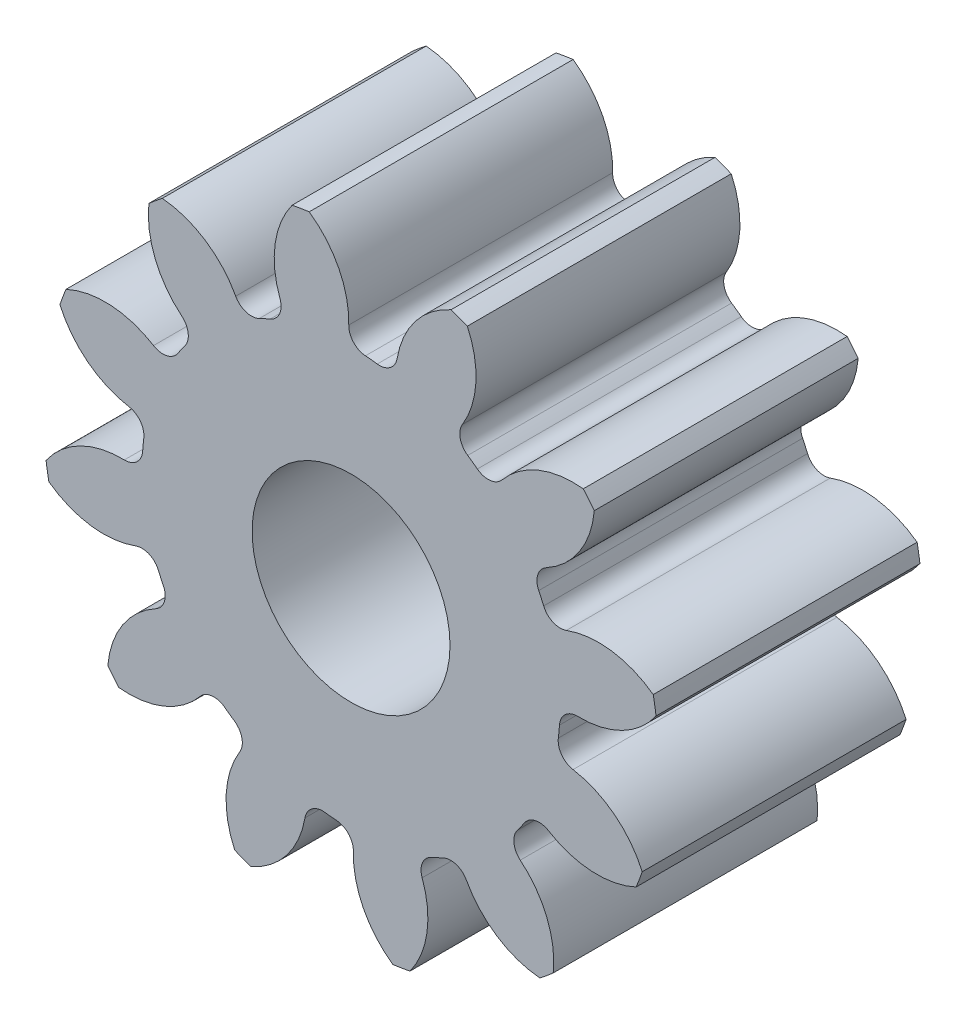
ISO-10303-21;
HEADER;
FILE_DESCRIPTION(('STEP AP214'),'2;1');
FILE_NAME('part.step','',(''),(''),'','','');
FILE_SCHEMA(('AUTOMOTIVE_DESIGN { 1 0 10303 214 1 1 1 1 }'));
ENDSEC;
DATA;
#1=APPLICATION_CONTEXT('core data for automotive mechanical design processes');
#2=APPLICATION_PROTOCOL_DEFINITION('international standard','automotive_design',2000,#1);
#3=PRODUCT_CONTEXT('',#1,'mechanical');
#4=PRODUCT('Part','Part','',(#3));
#5=PRODUCT_RELATED_PRODUCT_CATEGORY('part','',(#4));
#6=PRODUCT_DEFINITION_FORMATION('','',#4);
#7=PRODUCT_DEFINITION_CONTEXT('part definition',#1,'design');
#8=PRODUCT_DEFINITION('design','',#6,#7);
#9=PRODUCT_DEFINITION_SHAPE('','',#8);
#10=(LENGTH_UNIT() NAMED_UNIT(*) SI_UNIT(.MILLI.,.METRE.));
#11=(NAMED_UNIT(*) PLANE_ANGLE_UNIT() SI_UNIT($,.RADIAN.));
#12=(NAMED_UNIT(*) SI_UNIT($,.STERADIAN.) SOLID_ANGLE_UNIT());
#13=UNCERTAINTY_MEASURE_WITH_UNIT(LENGTH_MEASURE(1.E-05),#10,'distance_accuracy_value','');
#14=(GEOMETRIC_REPRESENTATION_CONTEXT(3) GLOBAL_UNCERTAINTY_ASSIGNED_CONTEXT((#13)) GLOBAL_UNIT_ASSIGNED_CONTEXT((#10,
#11,#12)) REPRESENTATION_CONTEXT('',''));
#15=CARTESIAN_POINT('',(0.,0.,0.));
#16=DIRECTION('',(0.,0.,1.));
#17=DIRECTION('',(1.,0.,0.));
#18=AXIS2_PLACEMENT_3D('',#15,#16,#17);
#19=CARTESIAN_POINT('',(0.,0.,101.6));
#20=DIRECTION('',(0.,0.,-1.));
#21=DIRECTION('',(-1.,0.,0.));
#22=AXIS2_PLACEMENT_3D('',#19,#20,#21);
#23=CYLINDRICAL_SURFACE('',#22,118.533333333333);
#24=DIRECTION('',(0.,0.,-1.));
#25=VECTOR('',#24,1.);
#26=CARTESIAN_POINT('',(116.338626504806,22.704076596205,50.8));
#27=LINE('',#26,#25);
#28=CARTESIAN_POINT('',(116.338626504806,22.704076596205,101.6));
#29=VERTEX_POINT('',#28);
#30=CARTESIAN_POINT('',(116.338626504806,22.704076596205,0.));
#31=VERTEX_POINT('',#30);
#32=EDGE_CURVE('E528',#29,#31,#27,.T.);
#33=ORIENTED_EDGE('',*,*,#32,.F.);
#34=CARTESIAN_POINT('',(0.,0.,101.6));
#35=DIRECTION('',(0.,0.,1.));
#36=DIRECTION('',(1.,0.,0.));
#37=AXIS2_PLACEMENT_3D('',#34,#35,#36);
#38=CIRCLE('',#37,118.533333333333);
#39=CARTESIAN_POINT('',(117.434466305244,16.102708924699,101.6));
#40=VERTEX_POINT('',#39);
#41=EDGE_CURVE('E945',#40,#29,#38,.T.);
#42=ORIENTED_EDGE('',*,*,#41,.F.);
#43=DIRECTION('',(0.,0.,-1.));
#44=VECTOR('',#43,1.);
#45=CARTESIAN_POINT('',(117.434466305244,16.102708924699,50.8));
#46=LINE('',#45,#44);
#47=CARTESIAN_POINT('',(117.434466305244,16.102708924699,0.));
#48=VERTEX_POINT('',#47);
#49=EDGE_CURVE('E939',#48,#40,#46,.F.);
#50=ORIENTED_EDGE('',*,*,#49,.F.);
#51=CARTESIAN_POINT('',(0.,0.,0.));
#52=DIRECTION('',(0.,0.,1.));
#53=DIRECTION('',(1.,0.,0.));
#54=AXIS2_PLACEMENT_3D('',#51,#52,#53);
#55=CIRCLE('',#54,118.533333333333);
#56=EDGE_CURVE('E950',#48,#31,#55,.T.);
#57=ORIENTED_EDGE('',*,*,#56,.T.);
#58=EDGE_LOOP('',(#33,#42,#50,#57));
#59=FACE_BOUND('',#58,.T.);
#60=ADVANCED_FACE('F33',(#59),#23,.T.);
#61=DIRECTION('',(0.,0.,-1.));
#62=VECTOR('',#61,1.);
#63=CARTESIAN_POINT('',(93.6498766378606,72.6625881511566,50.8));
#64=LINE('',#63,#62);
#65=CARTESIAN_POINT('',(93.6498766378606,72.6625881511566,0.));
#66=VERTEX_POINT('',#65);
#67=CARTESIAN_POINT('',(93.6498766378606,72.6625881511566,101.6));
#68=VERTEX_POINT('',#67);
#69=EDGE_CURVE('E499',#66,#68,#64,.F.);
#70=ORIENTED_EDGE('',*,*,#69,.F.);
#71=CARTESIAN_POINT('',(89.4001676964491,77.8316203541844,0.));
#72=VERTEX_POINT('',#71);
#73=EDGE_CURVE('E953',#66,#72,#55,.T.);
#74=ORIENTED_EDGE('',*,*,#73,.T.);
#75=DIRECTION('',(0.,0.,-1.));
#76=VECTOR('',#75,1.);
#77=CARTESIAN_POINT('',(89.4001676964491,77.8316203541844,50.8));
#78=LINE('',#77,#76);
#79=CARTESIAN_POINT('',(89.4001676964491,77.8316203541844,101.6));
#80=VERTEX_POINT('',#79);
#81=EDGE_CURVE('E561',#80,#72,#78,.T.);
#82=ORIENTED_EDGE('',*,*,#81,.F.);
#83=EDGE_CURVE('E948',#68,#80,#38,.T.);
#84=ORIENTED_EDGE('',*,*,#83,.F.);
#85=EDGE_LOOP('',(#70,#74,#82,#84));
#86=FACE_BOUND('',#85,.T.);
#87=ADVANCED_FACE('F1091',(#86),#23,.T.);
#88=CARTESIAN_POINT('',(0.,0.,101.6));
#89=DIRECTION('',(0.,0.,1.));
#90=DIRECTION('',(1.,0.,0.));
#91=AXIS2_PLACEMENT_3D('',#88,#89,#90);
#92=PLANE('',#91);
#93=CARTESIAN_POINT('',(0.,0.,101.599999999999));
#94=DIRECTION('',(0.,0.,1.));
#95=DIRECTION('',(1.,0.,0.));
#96=AXIS2_PLACEMENT_3D('',#93,#94,#95);
#97=CIRCLE('',#96,38.1);
#98=CARTESIAN_POINT('',(38.1,0.,101.599999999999));
#99=VERTEX_POINT('',#98);
#100=EDGE_CURVE('E516',#99,#99,#97,.T.);
#101=ORIENTED_EDGE('',*,*,#100,.F.);
#102=EDGE_LOOP('',(#101));
#103=FACE_BOUND('',#102,.T.);
#104=ORIENTED_EDGE('',*,*,#41,.T.);
#105=CARTESIAN_POINT('',(95.2791642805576,-6.07706486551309,101.6));
#106=DIRECTION('',(0.,0.,-1.));
#107=DIRECTION('',(0.866025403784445,0.499999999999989,0.));
#108=AXIS2_PLACEMENT_3D('',#105,#106,#107);
#109=CIRCLE('',#108,35.663076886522);
#110=CARTESIAN_POINT('',(82.898178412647,27.3679084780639,101.6));
#111=VERTEX_POINT('',#110);
#112=EDGE_CURVE('E508',#111,#29,#109,.T.);
#113=ORIENTED_EDGE('',*,*,#112,.F.);
#114=CARTESIAN_POINT('',(80.5055608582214,33.8311280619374,101.6));
#115=DIRECTION('',(0.,0.,1.));
#116=DIRECTION('',(-0.866025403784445,-0.499999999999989,0.));
#117=AXIS2_PLACEMENT_3D('',#114,#115,#116);
#118=CIRCLE('',#117,6.89186666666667);
#119=CARTESIAN_POINT('',(74.1519127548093,31.1611127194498,101.6));
#120=VERTEX_POINT('',#119);
#121=EDGE_CURVE('E506',#120,#111,#118,.T.);
#122=ORIENTED_EDGE('',*,*,#121,.F.);
#123=CARTESIAN_POINT('',(0.,0.,101.6));
#124=DIRECTION('',(0.,0.,-1.));
#125=DIRECTION('',(0.866025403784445,0.499999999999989,0.));
#126=AXIS2_PLACEMENT_3D('',#123,#124,#125);
#127=CIRCLE('',#126,80.4333333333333);
#128=CARTESIAN_POINT('',(72.2580428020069,35.331237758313,101.6));
#129=VERTEX_POINT('',#128);
#130=EDGE_CURVE('E491',#129,#120,#127,.T.);
#131=ORIENTED_EDGE('',*,*,#130,.F.);
#132=CARTESIAN_POINT('',(78.4494161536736,38.3585669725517,101.6));
#133=DIRECTION('',(0.,0.,1.));
#134=DIRECTION('',(-0.866025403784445,-0.499999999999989,0.));
#135=AXIS2_PLACEMENT_3D('',#132,#133,#134);
#136=CIRCLE('',#135,6.89186666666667);
#137=CARTESIAN_POINT('',(75.1570452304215,44.4131619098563,101.6));
#138=VERTEX_POINT('',#137);
#139=EDGE_CURVE('E483',#138,#129,#136,.T.);
#140=ORIENTED_EDGE('',*,*,#139,.F.);
#141=CARTESIAN_POINT('',(58.1201402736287,75.7436410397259,101.6));
#142=DIRECTION('',(0.,0.,-1.));
#143=DIRECTION('',(-0.866025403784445,-0.499999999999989,0.));
#144=AXIS2_PLACEMENT_3D('',#141,#142,#143);
#145=CIRCLE('',#144,35.663076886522);
#146=EDGE_CURVE('E513',#68,#138,#145,.T.);
#147=ORIENTED_EDGE('',*,*,#146,.F.);
#148=ORIENTED_EDGE('',*,*,#83,.T.);
#149=CARTESIAN_POINT('',(85.5527091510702,42.3766895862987,101.6));
#150=DIRECTION('',(0.,0.,-1.));
#151=DIRECTION('',(0.50000000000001,0.866025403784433,0.));
#152=AXIS2_PLACEMENT_3D('',#149,#150,#151);
#153=CIRCLE('',#152,35.663076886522);
#154=CARTESIAN_POINT('',(58.107974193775,65.1503931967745,101.6));
#155=VERTEX_POINT('',#154);
#156=EDGE_CURVE('E537',#155,#80,#153,.T.);
#157=ORIENTED_EDGE('',*,*,#156,.F.);
#158=CARTESIAN_POINT('',(52.8042968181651,69.5513967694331,101.6));
#159=DIRECTION('',(0.,0.,1.));
#160=DIRECTION('',(-0.50000000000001,-0.866025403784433,0.));
#161=AXIS2_PLACEMENT_3D('',#158,#159,#160);
#162=CIRCLE('',#161,6.89186666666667);
#163=CARTESIAN_POINT('',(48.6368838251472,64.0622716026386,101.6));
#164=VERTEX_POINT('',#163);
#165=EDGE_CURVE('E535',#164,#155,#162,.T.);
#166=ORIENTED_EDGE('',*,*,#165,.F.);
#167=CARTESIAN_POINT('',(0.,0.,101.6));
#168=DIRECTION('',(0.,0.,-1.));
#169=DIRECTION('',(0.50000000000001,0.866025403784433,0.));
#170=AXIS2_PLACEMENT_3D('',#167,#168,#169);
#171=CIRCLE('',#170,80.4333333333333);
#172=CARTESIAN_POINT('',(44.9116818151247,66.7267708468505,101.6));
#173=VERTEX_POINT('',#172);
#174=EDGE_CURVE('E532',#173,#164,#171,.T.);
#175=ORIENTED_EDGE('',*,*,#174,.F.);
#176=CARTESIAN_POINT('',(48.7599038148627,72.4442015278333,101.6));
#177=DIRECTION('',(0.,0.,1.));
#178=DIRECTION('',(-0.50000000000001,-0.866025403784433,0.));
#179=AXIS2_PLACEMENT_3D('',#176,#177,#178);
#180=CIRCLE('',#179,6.89186666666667);
#181=CARTESIAN_POINT('',(42.8813294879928,76.0414490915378,101.6));
#182=VERTEX_POINT('',#181);
#183=EDGE_CURVE('E530',#182,#173,#180,.T.);
#184=ORIENTED_EDGE('',*,*,#183,.F.);
#185=CARTESIAN_POINT('',(12.4616974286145,94.6559874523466,101.6));
#186=DIRECTION('',(0.,0.,-1.));
#187=DIRECTION('',(-0.50000000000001,-0.866025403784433,0.));
#188=AXIS2_PLACEMENT_3D('',#185,#186,#187);
#189=CIRCLE('',#188,35.663076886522);
#190=CARTESIAN_POINT('',(44.7718781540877,109.752585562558,101.6));
#191=VERTEX_POINT('',#190);
#192=EDGE_CURVE('E540',#191,#182,#189,.T.);
#193=ORIENTED_EDGE('',*,*,#192,.F.);
#194=CARTESIAN_POINT('',(38.5070061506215,112.104244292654,101.6));
#195=VERTEX_POINT('',#194);
#196=EDGE_CURVE('E985',#191,#195,#38,.T.);
#197=ORIENTED_EDGE('',*,*,#196,.T.);
#198=CARTESIAN_POINT('',(52.9024746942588,79.4756442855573,101.6));
#199=DIRECTION('',(0.,0.,-1.));
#200=DIRECTION('',(0.,1.,0.));
#201=AXIS2_PLACEMENT_3D('',#198,#199,#200);
#202=CIRCLE('',#201,35.663076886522);
#203=CARTESIAN_POINT('',(17.7477852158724,85.4758826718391,101.6));
#204=VERTEX_POINT('',#203);
#205=EDGE_CURVE('E572',#204,#195,#202,.T.);
#206=ORIENTED_EDGE('',*,*,#205,.F.);
#207=CARTESIAN_POINT('',(10.9541640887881,86.6354248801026,101.6));
#208=DIRECTION('',(0.,0.,1.));
#209=DIRECTION('',(0.,-1.,0.));
#210=AXIS2_PLACEMENT_3D('',#207,#208,#209);
#211=CIRCLE('',#210,6.89186666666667);
#212=CARTESIAN_POINT('',(10.0896411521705,79.7979965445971,101.6));
#213=VERTEX_POINT('',#212);
#214=EDGE_CURVE('E570',#213,#204,#211,.T.);
#215=ORIENTED_EDGE('',*,*,#214,.F.);
#216=CARTESIAN_POINT('',(0.,0.,101.6));
#217=DIRECTION('',(0.,0.,-1.));
#218=DIRECTION('',(0.,1.,0.));
#219=AXIS2_PLACEMENT_3D('',#216,#217,#218);
#220=CIRCLE('',#219,80.4333333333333);
#221=CARTESIAN_POINT('',(5.53127195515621,80.2429195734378,101.6));
#222=VERTEX_POINT('',#221);
#223=EDGE_CURVE('E567',#222,#213,#220,.T.);
#224=ORIENTED_EDGE('',*,*,#223,.F.);
#225=CARTESIAN_POINT('',(6.00521462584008,87.1184707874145,101.6));
#226=DIRECTION('',(0.,0.,1.));
#227=DIRECTION('',(0.,-1.,0.));
#228=AXIS2_PLACEMENT_3D('',#225,#226,#227);
#229=CIRCLE('',#228,6.89186666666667);
#230=CARTESIAN_POINT('',(-0.88440386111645,87.2944913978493,101.6));
#231=VERTEX_POINT('',#230);
#232=EDGE_CURVE('E565',#231,#222,#229,.T.);
#233=ORIENTED_EDGE('',*,*,#232,.F.);
#234=CARTESIAN_POINT('',(-36.535847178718,88.2053384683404,101.6));
#235=DIRECTION('',(0.,0.,-1.));
#236=DIRECTION('',(0.,-1.,0.));
#237=AXIS2_PLACEMENT_3D('',#234,#235,#236);
#238=CIRCLE('',#237,35.663076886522);
#239=CARTESIAN_POINT('',(-16.1027089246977,117.434466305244,101.6));
#240=VERTEX_POINT('',#239);
#241=EDGE_CURVE('E575',#240,#231,#238,.T.);
#242=ORIENTED_EDGE('',*,*,#241,.F.);
#243=CARTESIAN_POINT('',(-22.7040765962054,116.338626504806,101.6));
#244=VERTEX_POINT('',#243);
#245=EDGE_CURVE('E1073',#240,#244,#38,.T.);
#246=ORIENTED_EDGE('',*,*,#245,.T.);
#247=CARTESIAN_POINT('',(6.07706486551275,95.2791642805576,101.6));
#248=DIRECTION('',(0.,0.,-1.));
#249=DIRECTION('',(-0.499999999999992,0.866025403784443,0.));
#250=AXIS2_PLACEMENT_3D('',#247,#248,#249);
#251=CIRCLE('',#250,35.663076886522);
#252=CARTESIAN_POINT('',(-27.3679084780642,82.8981784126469,101.6));
#253=VERTEX_POINT('',#252);
#254=EDGE_CURVE('E610',#253,#244,#251,.T.);
#255=ORIENTED_EDGE('',*,*,#254,.F.);
#256=CARTESIAN_POINT('',(-33.8311280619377,80.5055608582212,101.6));
#257=DIRECTION('',(0.,0.,1.));
#258=DIRECTION('',(0.499999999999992,-0.866025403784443,0.));
#259=AXIS2_PLACEMENT_3D('',#256,#257,#258);
#260=CIRCLE('',#259,6.89186666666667);
#261=CARTESIAN_POINT('',(-31.1611127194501,74.1519127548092,101.6));
#262=VERTEX_POINT('',#261);
#263=EDGE_CURVE('E608',#262,#253,#260,.T.);
#264=ORIENTED_EDGE('',*,*,#263,.F.);
#265=CARTESIAN_POINT('',(0.,0.,101.6));
#266=DIRECTION('',(0.,0.,-1.));
#267=DIRECTION('',(-0.499999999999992,0.866025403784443,0.));
#268=AXIS2_PLACEMENT_3D('',#265,#266,#267);
#269=CIRCLE('',#268,80.4333333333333);
#270=CARTESIAN_POINT('',(-35.3312377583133,72.2580428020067,101.6));
#271=VERTEX_POINT('',#270);
#272=EDGE_CURVE('E605',#271,#262,#269,.T.);
#273=ORIENTED_EDGE('',*,*,#272,.F.);
#274=CARTESIAN_POINT('',(-38.358566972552,78.4494161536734,101.6));
#275=DIRECTION('',(0.,0.,1.));
#276=DIRECTION('',(0.499999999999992,-0.866025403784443,0.));
#277=AXIS2_PLACEMENT_3D('',#274,#275,#276);
#278=CIRCLE('',#277,6.89186666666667);
#279=CARTESIAN_POINT('',(-44.4131619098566,75.1570452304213,101.6));
#280=VERTEX_POINT('',#279);
#281=EDGE_CURVE('E603',#280,#271,#278,.T.);
#282=ORIENTED_EDGE('',*,*,#281,.F.);
#283=CARTESIAN_POINT('',(-75.7436410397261,58.1201402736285,101.6));
#284=DIRECTION('',(0.,0.,-1.));
#285=DIRECTION('',(0.499999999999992,-0.866025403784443,0.));
#286=AXIS2_PLACEMENT_3D('',#283,#284,#285);
#287=CIRCLE('',#286,35.663076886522);
#288=CARTESIAN_POINT('',(-72.6625881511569,93.6498766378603,101.6));
#289=VERTEX_POINT('',#288);
#290=EDGE_CURVE('E613',#289,#280,#287,.T.);
#291=ORIENTED_EDGE('',*,*,#290,.F.);
#292=CARTESIAN_POINT('',(-77.8316203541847,89.4001676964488,101.6));
#293=VERTEX_POINT('',#292);
#294=EDGE_CURVE('E1069',#289,#293,#38,.T.);
#295=ORIENTED_EDGE('',*,*,#294,.T.);
#296=CARTESIAN_POINT('',(-42.376689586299,85.5527091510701,101.6));
#297=DIRECTION('',(0.,0.,-1.));
#298=DIRECTION('',(-0.866025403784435,0.500000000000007,0.));
#299=AXIS2_PLACEMENT_3D('',#296,#297,#298);
#300=CIRCLE('',#299,35.663076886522);
#301=CARTESIAN_POINT('',(-65.1503931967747,58.1079741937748,101.6));
#302=VERTEX_POINT('',#301);
#303=EDGE_CURVE('E648',#302,#293,#300,.T.);
#304=ORIENTED_EDGE('',*,*,#303,.F.);
#305=CARTESIAN_POINT('',(-69.5513967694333,52.8042968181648,101.6));
#306=DIRECTION('',(0.,0.,1.));
#307=DIRECTION('',(0.866025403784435,-0.500000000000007,0.));
#308=AXIS2_PLACEMENT_3D('',#305,#306,#307);
#309=CIRCLE('',#308,6.89186666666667);
#310=CARTESIAN_POINT('',(-64.0622716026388,48.636883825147,101.6));
#311=VERTEX_POINT('',#310);
#312=EDGE_CURVE('E646',#311,#302,#309,.T.);
#313=ORIENTED_EDGE('',*,*,#312,.F.);
#314=CARTESIAN_POINT('',(0.,0.,101.6));
#315=DIRECTION('',(0.,0.,-1.));
#316=DIRECTION('',(-0.866025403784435,0.500000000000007,0.));
#317=AXIS2_PLACEMENT_3D('',#314,#315,#316);
#318=CIRCLE('',#317,80.4333333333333);
#319=CARTESIAN_POINT('',(-66.7267708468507,44.9116818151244,101.6));
#320=VERTEX_POINT('',#319);
#321=EDGE_CURVE('E643',#320,#311,#318,.T.);
#322=ORIENTED_EDGE('',*,*,#321,.F.);
#323=CARTESIAN_POINT('',(-72.4442015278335,48.7599038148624,101.6));
#324=DIRECTION('',(0.,0.,1.));
#325=DIRECTION('',(0.866025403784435,-0.500000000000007,0.));
#326=AXIS2_PLACEMENT_3D('',#323,#324,#325);
#327=CIRCLE('',#326,6.89186666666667);
#328=CARTESIAN_POINT('',(-76.041449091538,42.8813294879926,101.6));
#329=VERTEX_POINT('',#328);
#330=EDGE_CURVE('E641',#329,#320,#327,.T.);
#331=ORIENTED_EDGE('',*,*,#330,.F.);
#332=CARTESIAN_POINT('',(-94.6559874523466,12.4616974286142,101.6));
#333=DIRECTION('',(0.,0.,-1.));
#334=DIRECTION('',(0.866025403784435,-0.500000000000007,0.));
#335=AXIS2_PLACEMENT_3D('',#332,#333,#334);
#336=CIRCLE('',#335,35.663076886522);
#337=CARTESIAN_POINT('',(-109.752585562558,44.7718781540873,101.6));
#338=VERTEX_POINT('',#337);
#339=EDGE_CURVE('E651',#338,#329,#336,.T.);
#340=ORIENTED_EDGE('',*,*,#339,.F.);
#341=CARTESIAN_POINT('',(-112.104244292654,38.5070061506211,101.6));
#342=VERTEX_POINT('',#341);
#343=EDGE_CURVE('E1065',#338,#342,#38,.T.);
#344=ORIENTED_EDGE('',*,*,#343,.T.);
#345=CARTESIAN_POINT('',(-79.4756442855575,52.9024746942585,101.6));
#346=DIRECTION('',(0.,0.,-1.));
#347=DIRECTION('',(-1.,0.,0.));
#348=AXIS2_PLACEMENT_3D('',#345,#346,#347);
#349=CIRCLE('',#348,35.663076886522);
#350=CARTESIAN_POINT('',(-85.4758826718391,17.7477852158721,101.6));
#351=VERTEX_POINT('',#350);
#352=EDGE_CURVE('E686',#351,#342,#349,.T.);
#353=ORIENTED_EDGE('',*,*,#352,.F.);
#354=CARTESIAN_POINT('',(-86.6354248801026,10.9541640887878,101.6));
#355=DIRECTION('',(0.,0.,1.));
#356=DIRECTION('',(1.,0.,0.));
#357=AXIS2_PLACEMENT_3D('',#354,#355,#356);
#358=CIRCLE('',#357,6.89186666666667);
#359=CARTESIAN_POINT('',(-79.7979965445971,10.0896411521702,101.6));
#360=VERTEX_POINT('',#359);
#361=EDGE_CURVE('E684',#360,#351,#358,.T.);
#362=ORIENTED_EDGE('',*,*,#361,.F.);
#363=CARTESIAN_POINT('',(0.,0.,101.6));
#364=DIRECTION('',(0.,0.,-1.));
#365=DIRECTION('',(-1.,0.,0.));
#366=AXIS2_PLACEMENT_3D('',#363,#364,#365);
#367=CIRCLE('',#366,80.4333333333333);
#368=CARTESIAN_POINT('',(-80.2429195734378,5.53127195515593,101.6));
#369=VERTEX_POINT('',#368);
#370=EDGE_CURVE('E681',#369,#360,#367,.T.);
#371=ORIENTED_EDGE('',*,*,#370,.F.);
#372=CARTESIAN_POINT('',(-87.1184707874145,6.00521462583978,101.6));
#373=DIRECTION('',(0.,0.,1.));
#374=DIRECTION('',(1.,0.,0.));
#375=AXIS2_PLACEMENT_3D('',#372,#373,#374);
#376=CIRCLE('',#375,6.89186666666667);
#377=CARTESIAN_POINT('',(-87.2944913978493,-0.884403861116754,101.6));
#378=VERTEX_POINT('',#377);
#379=EDGE_CURVE('E679',#378,#369,#376,.T.);
#380=ORIENTED_EDGE('',*,*,#379,.F.);
#381=CARTESIAN_POINT('',(-88.2053384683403,-36.5358471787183,101.6));
#382=DIRECTION('',(0.,0.,-1.));
#383=DIRECTION('',(1.,0.,0.));
#384=AXIS2_PLACEMENT_3D('',#381,#382,#383);
#385=CIRCLE('',#384,35.663076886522);
#386=CARTESIAN_POINT('',(-117.434466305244,-16.1027089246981,101.6));
#387=VERTEX_POINT('',#386);
#388=EDGE_CURVE('E689',#387,#378,#385,.T.);
#389=ORIENTED_EDGE('',*,*,#388,.F.);
#390=CARTESIAN_POINT('',(-116.338626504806,-22.7040765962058,101.6));
#391=VERTEX_POINT('',#390);
#392=EDGE_CURVE('E1061',#387,#391,#38,.T.);
#393=ORIENTED_EDGE('',*,*,#392,.T.);
#394=CARTESIAN_POINT('',(-95.2791642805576,6.07706486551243,101.6));
#395=DIRECTION('',(0.,0.,-1.));
#396=DIRECTION('',(-0.866025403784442,-0.499999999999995,0.));
#397=AXIS2_PLACEMENT_3D('',#394,#395,#396);
#398=CIRCLE('',#397,35.663076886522);
#399=CARTESIAN_POINT('',(-82.8981784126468,-27.3679084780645,101.6));
#400=VERTEX_POINT('',#399);
#401=EDGE_CURVE('E724',#400,#391,#398,.T.);
#402=ORIENTED_EDGE('',*,*,#401,.F.);
#403=CARTESIAN_POINT('',(-80.5055608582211,-33.831128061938,101.6));
#404=DIRECTION('',(0.,0.,1.));
#405=DIRECTION('',(0.866025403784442,0.499999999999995,0.));
#406=AXIS2_PLACEMENT_3D('',#403,#404,#405);
#407=CIRCLE('',#406,6.89186666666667);
#408=CARTESIAN_POINT('',(-74.1519127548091,-31.1611127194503,101.6));
#409=VERTEX_POINT('',#408);
#410=EDGE_CURVE('E722',#409,#400,#407,.T.);
#411=ORIENTED_EDGE('',*,*,#410,.F.);
#412=CARTESIAN_POINT('',(0.,0.,101.6));
#413=DIRECTION('',(0.,0.,-1.));
#414=DIRECTION('',(-0.866025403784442,-0.499999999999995,0.));
#415=AXIS2_PLACEMENT_3D('',#412,#413,#414);
#416=CIRCLE('',#415,80.4333333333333);
#417=CARTESIAN_POINT('',(-72.2580428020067,-35.3312377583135,101.6));
#418=VERTEX_POINT('',#417);
#419=EDGE_CURVE('E719',#418,#409,#416,.T.);
#420=ORIENTED_EDGE('',*,*,#419,.F.);
#421=CARTESIAN_POINT('',(-78.4494161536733,-38.3585669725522,101.6));
#422=DIRECTION('',(0.,0.,1.));
#423=DIRECTION('',(0.866025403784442,0.499999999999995,0.));
#424=AXIS2_PLACEMENT_3D('',#421,#422,#423);
#425=CIRCLE('',#424,6.89186666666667);
#426=CARTESIAN_POINT('',(-75.1570452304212,-44.4131619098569,101.6));
#427=VERTEX_POINT('',#426);
#428=EDGE_CURVE('E717',#427,#418,#425,.T.);
#429=ORIENTED_EDGE('',*,*,#428,.F.);
#430=CARTESIAN_POINT('',(-58.1201402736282,-75.7436410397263,101.6));
#431=DIRECTION('',(0.,0.,-1.));
#432=DIRECTION('',(0.866025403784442,0.499999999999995,0.));
#433=AXIS2_PLACEMENT_3D('',#430,#431,#432);
#434=CIRCLE('',#433,35.663076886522);
#435=CARTESIAN_POINT('',(-93.6498766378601,-72.6625881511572,101.6));
#436=VERTEX_POINT('',#435);
#437=EDGE_CURVE('E727',#436,#427,#434,.T.);
#438=ORIENTED_EDGE('',*,*,#437,.F.);
#439=CARTESIAN_POINT('',(-89.4001676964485,-77.8316203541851,101.6));
#440=VERTEX_POINT('',#439);
#441=EDGE_CURVE('E1057',#436,#440,#38,.T.);
#442=ORIENTED_EDGE('',*,*,#441,.T.);
#443=CARTESIAN_POINT('',(-85.5527091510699,-42.3766895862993,101.6));
#444=DIRECTION('',(0.,0.,-1.));
#445=DIRECTION('',(-0.500000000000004,-0.866025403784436,0.));
#446=AXIS2_PLACEMENT_3D('',#443,#444,#445);
#447=CIRCLE('',#446,35.663076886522);
#448=CARTESIAN_POINT('',(-58.1079741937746,-65.1503931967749,101.6));
#449=VERTEX_POINT('',#448);
#450=EDGE_CURVE('E762',#449,#440,#447,.T.);
#451=ORIENTED_EDGE('',*,*,#450,.F.);
#452=CARTESIAN_POINT('',(-52.8042968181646,-69.5513967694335,101.6));
#453=DIRECTION('',(0.,0.,1.));
#454=DIRECTION('',(0.500000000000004,0.866025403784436,0.));
#455=AXIS2_PLACEMENT_3D('',#452,#453,#454);
#456=CIRCLE('',#455,6.89186666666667);
#457=CARTESIAN_POINT('',(-48.6368838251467,-64.062271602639,101.6));
#458=VERTEX_POINT('',#457);
#459=EDGE_CURVE('E760',#458,#449,#456,.T.);
#460=ORIENTED_EDGE('',*,*,#459,.F.);
#461=CARTESIAN_POINT('',(0.,0.,101.6));
#462=DIRECTION('',(0.,0.,-1.));
#463=DIRECTION('',(-0.500000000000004,-0.866025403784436,0.));
#464=AXIS2_PLACEMENT_3D('',#461,#462,#463);
#465=CIRCLE('',#464,80.4333333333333);
#466=CARTESIAN_POINT('',(-44.9116818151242,-66.7267708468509,101.6));
#467=VERTEX_POINT('',#466);
#468=EDGE_CURVE('E757',#467,#458,#465,.T.);
#469=ORIENTED_EDGE('',*,*,#468,.F.);
#470=CARTESIAN_POINT('',(-48.7599038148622,-72.4442015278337,101.6));
#471=DIRECTION('',(0.,0.,1.));
#472=DIRECTION('',(0.500000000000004,0.866025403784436,0.));
#473=AXIS2_PLACEMENT_3D('',#470,#471,#472);
#474=CIRCLE('',#473,6.89186666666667);
#475=CARTESIAN_POINT('',(-42.8813294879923,-76.0414490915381,101.6));
#476=VERTEX_POINT('',#475);
#477=EDGE_CURVE('E755',#476,#467,#474,.T.);
#478=ORIENTED_EDGE('',*,*,#477,.F.);
#479=CARTESIAN_POINT('',(-12.4616974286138,-94.6559874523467,101.6));
#480=DIRECTION('',(0.,0.,-1.));
#481=DIRECTION('',(0.500000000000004,0.866025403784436,0.));
#482=AXIS2_PLACEMENT_3D('',#479,#480,#481);
#483=CIRCLE('',#482,35.663076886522);
#484=CARTESIAN_POINT('',(-44.7718781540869,-109.752585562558,101.6));
#485=VERTEX_POINT('',#484);
#486=EDGE_CURVE('E765',#485,#476,#483,.T.);
#487=ORIENTED_EDGE('',*,*,#486,.F.);
#488=CARTESIAN_POINT('',(-38.5070061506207,-112.104244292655,101.6));
#489=VERTEX_POINT('',#488);
#490=EDGE_CURVE('E1053',#485,#489,#38,.T.);
#491=ORIENTED_EDGE('',*,*,#490,.T.);
#492=CARTESIAN_POINT('',(-52.9024746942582,-79.4756442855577,101.6));
#493=DIRECTION('',(0.,0.,-1.));
#494=DIRECTION('',(0.,-1.,0.));
#495=AXIS2_PLACEMENT_3D('',#492,#493,#494);
#496=CIRCLE('',#495,35.663076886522);
#497=CARTESIAN_POINT('',(-17.7477852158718,-85.4758826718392,101.6));
#498=VERTEX_POINT('',#497);
#499=EDGE_CURVE('E800',#498,#489,#496,.T.);
#500=ORIENTED_EDGE('',*,*,#499,.F.);
#501=CARTESIAN_POINT('',(-10.9541640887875,-86.6354248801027,101.6));
#502=DIRECTION('',(0.,0.,1.));
#503=DIRECTION('',(0.,1.,0.));
#504=AXIS2_PLACEMENT_3D('',#501,#502,#503);
#505=CIRCLE('',#504,6.89186666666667);
#506=CARTESIAN_POINT('',(-10.08964115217,-79.7979965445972,101.6));
#507=VERTEX_POINT('',#506);
#508=EDGE_CURVE('E798',#507,#498,#505,.T.);
#509=ORIENTED_EDGE('',*,*,#508,.F.);
#510=CARTESIAN_POINT('',(0.,0.,101.6));
#511=DIRECTION('',(0.,0.,-1.));
#512=DIRECTION('',(0.,-1.,0.));
#513=AXIS2_PLACEMENT_3D('',#510,#511,#512);
#514=CIRCLE('',#513,80.4333333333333);
#515=CARTESIAN_POINT('',(-5.53127195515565,-80.2429195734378,101.6));
#516=VERTEX_POINT('',#515);
#517=EDGE_CURVE('E795',#516,#507,#514,.T.);
#518=ORIENTED_EDGE('',*,*,#517,.F.);
#519=CARTESIAN_POINT('',(-6.00521462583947,-87.1184707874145,101.6));
#520=DIRECTION('',(0.,0.,1.));
#521=DIRECTION('',(0.,1.,0.));
#522=AXIS2_PLACEMENT_3D('',#519,#520,#521);
#523=CIRCLE('',#522,6.89186666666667);
#524=CARTESIAN_POINT('',(0.884403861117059,-87.2944913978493,101.6));
#525=VERTEX_POINT('',#524);
#526=EDGE_CURVE('E793',#525,#516,#523,.T.);
#527=ORIENTED_EDGE('',*,*,#526,.F.);
#528=CARTESIAN_POINT('',(36.5358471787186,-88.2053384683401,101.6));
#529=DIRECTION('',(0.,0.,-1.));
#530=DIRECTION('',(0.,1.,0.));
#531=AXIS2_PLACEMENT_3D('',#528,#529,#530);
#532=CIRCLE('',#531,35.663076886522);
#533=CARTESIAN_POINT('',(16.1027089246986,-117.434466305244,101.6));
#534=VERTEX_POINT('',#533);
#535=EDGE_CURVE('E803',#534,#525,#532,.T.);
#536=ORIENTED_EDGE('',*,*,#535,.F.);
#537=CARTESIAN_POINT('',(22.7040765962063,-116.338626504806,101.6));
#538=VERTEX_POINT('',#537);
#539=EDGE_CURVE('E1049',#534,#538,#38,.T.);
#540=ORIENTED_EDGE('',*,*,#539,.T.);
#541=CARTESIAN_POINT('',(-6.07706486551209,-95.2791642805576,101.6));
#542=DIRECTION('',(0.,0.,-1.));
#543=DIRECTION('',(0.499999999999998,-0.86602540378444,0.));
#544=AXIS2_PLACEMENT_3D('',#541,#542,#543);
#545=CIRCLE('',#544,35.663076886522);
#546=CARTESIAN_POINT('',(27.3679084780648,-82.8981784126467,101.6));
#547=VERTEX_POINT('',#546);
#548=EDGE_CURVE('E838',#547,#538,#545,.T.);
#549=ORIENTED_EDGE('',*,*,#548,.F.);
#550=CARTESIAN_POINT('',(33.8311280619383,-80.505560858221,101.6));
#551=DIRECTION('',(0.,0.,1.));
#552=DIRECTION('',(-0.499999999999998,0.86602540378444,0.));
#553=AXIS2_PLACEMENT_3D('',#550,#551,#552);
#554=CIRCLE('',#553,6.89186666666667);
#555=CARTESIAN_POINT('',(31.1611127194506,-74.1519127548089,101.6));
#556=VERTEX_POINT('',#555);
#557=EDGE_CURVE('E836',#556,#547,#554,.T.);
#558=ORIENTED_EDGE('',*,*,#557,.F.);
#559=CARTESIAN_POINT('',(0.,0.,101.6));
#560=DIRECTION('',(0.,0.,-1.));
#561=DIRECTION('',(0.499999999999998,-0.86602540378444,0.));
#562=AXIS2_PLACEMENT_3D('',#559,#560,#561);
#563=CIRCLE('',#562,80.4333333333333);
#564=CARTESIAN_POINT('',(35.3312377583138,-72.2580428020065,101.6));
#565=VERTEX_POINT('',#564);
#566=EDGE_CURVE('E833',#565,#556,#563,.T.);
#567=ORIENTED_EDGE('',*,*,#566,.F.);
#568=CARTESIAN_POINT('',(38.3585669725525,-78.4494161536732,101.6));
#569=DIRECTION('',(0.,0.,1.));
#570=DIRECTION('',(-0.499999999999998,0.86602540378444,0.));
#571=AXIS2_PLACEMENT_3D('',#568,#569,#570);
#572=CIRCLE('',#571,6.89186666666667);
#573=CARTESIAN_POINT('',(44.4131619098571,-75.157045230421,101.6));
#574=VERTEX_POINT('',#573);
#575=EDGE_CURVE('E831',#574,#565,#572,.T.);
#576=ORIENTED_EDGE('',*,*,#575,.F.);
#577=CARTESIAN_POINT('',(75.7436410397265,-58.1201402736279,101.6));
#578=DIRECTION('',(0.,0.,-1.));
#579=DIRECTION('',(-0.499999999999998,0.86602540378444,0.));
#580=AXIS2_PLACEMENT_3D('',#577,#578,#579);
#581=CIRCLE('',#580,35.663076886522);
#582=CARTESIAN_POINT('',(72.6625881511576,-93.6498766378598,101.6));
#583=VERTEX_POINT('',#582);
#584=EDGE_CURVE('E841',#583,#574,#581,.T.);
#585=ORIENTED_EDGE('',*,*,#584,.F.);
#586=CARTESIAN_POINT('',(77.8316203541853,-89.4001676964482,101.6));
#587=VERTEX_POINT('',#586);
#588=EDGE_CURVE('E1048',#583,#587,#38,.T.);
#589=ORIENTED_EDGE('',*,*,#588,.T.);
#590=CARTESIAN_POINT('',(42.3766895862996,-85.5527091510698,101.6));
#591=DIRECTION('',(0.,0.,-1.));
#592=DIRECTION('',(0.866025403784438,-0.500000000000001,0.));
#593=AXIS2_PLACEMENT_3D('',#590,#591,#592);
#594=CIRCLE('',#593,35.663076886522);
#595=CARTESIAN_POINT('',(65.1503931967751,-58.1079741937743,101.6));
#596=VERTEX_POINT('',#595);
#597=EDGE_CURVE('E876',#596,#587,#594,.T.);
#598=ORIENTED_EDGE('',*,*,#597,.F.);
#599=CARTESIAN_POINT('',(69.5513967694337,-52.8042968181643,101.6));
#600=DIRECTION('',(0.,0.,1.));
#601=DIRECTION('',(-0.866025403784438,0.500000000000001,0.));
#602=AXIS2_PLACEMENT_3D('',#599,#600,#601);
#603=CIRCLE('',#602,6.89186666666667);
#604=CARTESIAN_POINT('',(64.0622716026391,-48.6368838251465,101.6));
#605=VERTEX_POINT('',#604);
#606=EDGE_CURVE('E874',#605,#596,#603,.T.);
#607=ORIENTED_EDGE('',*,*,#606,.F.);
#608=CARTESIAN_POINT('',(0.,0.,101.6));
#609=DIRECTION('',(0.,0.,-1.));
#610=DIRECTION('',(0.866025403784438,-0.500000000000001,0.));
#611=AXIS2_PLACEMENT_3D('',#608,#609,#610);
#612=CIRCLE('',#611,80.4333333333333);
#613=CARTESIAN_POINT('',(66.726770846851,-44.911681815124,101.6));
#614=VERTEX_POINT('',#613);
#615=EDGE_CURVE('E871',#614,#605,#612,.T.);
#616=ORIENTED_EDGE('',*,*,#615,.F.);
#617=CARTESIAN_POINT('',(72.4442015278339,-48.7599038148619,101.6));
#618=DIRECTION('',(0.,0.,1.));
#619=DIRECTION('',(-0.866025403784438,0.500000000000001,0.));
#620=AXIS2_PLACEMENT_3D('',#617,#618,#619);
#621=CIRCLE('',#620,6.89186666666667);
#622=CARTESIAN_POINT('',(76.0414490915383,-42.881329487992,101.6));
#623=VERTEX_POINT('',#622);
#624=EDGE_CURVE('E869',#623,#614,#621,.T.);
#625=ORIENTED_EDGE('',*,*,#624,.F.);
#626=CARTESIAN_POINT('',(94.6559874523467,-12.4616974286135,101.6));
#627=DIRECTION('',(0.,0.,-1.));
#628=DIRECTION('',(-0.866025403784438,0.500000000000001,0.));
#629=AXIS2_PLACEMENT_3D('',#626,#627,#628);
#630=CIRCLE('',#629,35.663076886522);
#631=CARTESIAN_POINT('',(109.752585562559,-44.7718781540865,101.6));
#632=VERTEX_POINT('',#631);
#633=EDGE_CURVE('E879',#632,#623,#630,.T.);
#634=ORIENTED_EDGE('',*,*,#633,.F.);
#635=CARTESIAN_POINT('',(112.104244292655,-38.5070061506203,101.6));
#636=VERTEX_POINT('',#635);
#637=EDGE_CURVE('E949',#632,#636,#38,.T.);
#638=ORIENTED_EDGE('',*,*,#637,.T.);
#639=CARTESIAN_POINT('',(79.4756442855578,-52.902474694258,101.6));
#640=DIRECTION('',(0.,0.,-1.));
#641=DIRECTION('',(1.,0.,0.));
#642=AXIS2_PLACEMENT_3D('',#639,#640,#641);
#643=CIRCLE('',#642,35.663076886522);
#644=CARTESIAN_POINT('',(85.4758826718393,-17.7477852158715,101.6));
#645=VERTEX_POINT('',#644);
#646=EDGE_CURVE('E914',#645,#636,#643,.T.);
#647=ORIENTED_EDGE('',*,*,#646,.F.);
#648=CARTESIAN_POINT('',(86.6354248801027,-10.9541640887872,101.6));
#649=DIRECTION('',(0.,0.,1.));
#650=DIRECTION('',(-1.,0.,0.));
#651=AXIS2_PLACEMENT_3D('',#648,#649,#650);
#652=CIRCLE('',#651,6.89186666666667);
#653=CARTESIAN_POINT('',(79.7979965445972,-10.0896411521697,101.6));
#654=VERTEX_POINT('',#653);
#655=EDGE_CURVE('E912',#654,#645,#652,.T.);
#656=ORIENTED_EDGE('',*,*,#655,.F.);
#657=CARTESIAN_POINT('',(0.,0.,101.6));
#658=DIRECTION('',(0.,0.,-1.));
#659=DIRECTION('',(1.,0.,0.));
#660=AXIS2_PLACEMENT_3D('',#657,#658,#659);
#661=CIRCLE('',#660,80.4333333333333);
#662=CARTESIAN_POINT('',(80.2429195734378,-5.53127195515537,101.6));
#663=VERTEX_POINT('',#662);
#664=EDGE_CURVE('E909',#663,#654,#661,.T.);
#665=ORIENTED_EDGE('',*,*,#664,.F.);
#666=CARTESIAN_POINT('',(87.1184707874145,-6.00521462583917,101.6));
#667=DIRECTION('',(0.,0.,1.));
#668=DIRECTION('',(-1.,0.,0.));
#669=AXIS2_PLACEMENT_3D('',#666,#667,#668);
#670=CIRCLE('',#669,6.89186666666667);
#671=CARTESIAN_POINT('',(87.2944913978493,0.884403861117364,101.6));
#672=VERTEX_POINT('',#671);
#673=EDGE_CURVE('E907',#672,#663,#670,.T.);
#674=ORIENTED_EDGE('',*,*,#673,.F.);
#675=CARTESIAN_POINT('',(88.20533846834,36.5358471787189,101.6));
#676=DIRECTION('',(0.,0.,-1.));
#677=DIRECTION('',(-1.,0.,0.));
#678=AXIS2_PLACEMENT_3D('',#675,#676,#677);
#679=CIRCLE('',#678,35.663076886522);
#680=EDGE_CURVE('E917',#40,#672,#679,.T.);
#681=ORIENTED_EDGE('',*,*,#680,.F.);
#682=EDGE_LOOP('',(#104,#113,#122,#131,#140,#147,#148,#157,#166,#175,#184,#193,#197,#206,#215,
#224,#233,#242,#246,#255,#264,#273,#282,#291,#295,#304,#313,#322,#331,#340,#344,#353,#362,#371,
#380,#389,#393,#402,#411,#420,#429,#438,#442,#451,#460,#469,#478,#487,#491,#500,#509,#518,#527,
#536,#540,#549,#558,#567,#576,#585,#589,#598,#607,#616,#625,#634,#638,#647,#656,#665,#674,#681));
#683=FACE_BOUND('',#682,.T.);
#684=ADVANCED_FACE('F504',(#103,#683),#92,.T.);
#685=CARTESIAN_POINT('',(0.,0.,0.));
#686=DIRECTION('',(0.,0.,1.));
#687=DIRECTION('',(1.,0.,0.));
#688=AXIS2_PLACEMENT_3D('',#685,#686,#687);
#689=PLANE('',#688);
#690=CARTESIAN_POINT('',(0.,0.,0.));
#691=DIRECTION('',(0.,0.,1.));
#692=DIRECTION('',(1.,0.,0.));
#693=AXIS2_PLACEMENT_3D('',#690,#691,#692);
#694=CIRCLE('',#693,38.1);
#695=CARTESIAN_POINT('',(38.1,0.,-1.77635683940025E-12));
#696=VERTEX_POINT('',#695);
#697=EDGE_CURVE('E36',#696,#696,#694,.T.);
#698=ORIENTED_EDGE('',*,*,#697,.T.);
#699=EDGE_LOOP('',(#698));
#700=FACE_BOUND('',#699,.T.);
#701=CARTESIAN_POINT('',(95.2791642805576,-6.07706486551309,0.));
#702=DIRECTION('',(0.,0.,-1.));
#703=DIRECTION('',(0.866025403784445,0.499999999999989,0.));
#704=AXIS2_PLACEMENT_3D('',#701,#702,#703);
#705=CIRCLE('',#704,35.663076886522);
#706=CARTESIAN_POINT('',(82.898178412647,27.3679084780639,0.));
#707=VERTEX_POINT('',#706);
#708=EDGE_CURVE('E492',#707,#31,#705,.T.);
#709=ORIENTED_EDGE('',*,*,#708,.T.);
#710=ORIENTED_EDGE('',*,*,#56,.F.);
#711=CARTESIAN_POINT('',(88.20533846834,36.5358471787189,0.));
#712=DIRECTION('',(0.,0.,1.));
#713=DIRECTION('',(1.,0.,0.));
#714=AXIS2_PLACEMENT_3D('',#711,#712,#713);
#715=CIRCLE('',#714,35.663076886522);
#716=CARTESIAN_POINT('',(87.2944913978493,0.884403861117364,0.));
#717=VERTEX_POINT('',#716);
#718=EDGE_CURVE('E947',#717,#48,#715,.T.);
#719=ORIENTED_EDGE('',*,*,#718,.F.);
#720=CARTESIAN_POINT('',(87.1184707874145,-6.00521462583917,0.));
#721=DIRECTION('',(0.,0.,1.));
#722=DIRECTION('',(-1.,0.,0.));
#723=AXIS2_PLACEMENT_3D('',#720,#721,#722);
#724=CIRCLE('',#723,6.89186666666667);
#725=CARTESIAN_POINT('',(80.2429195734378,-5.53127195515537,0.));
#726=VERTEX_POINT('',#725);
#727=EDGE_CURVE('E906',#717,#726,#724,.T.);
#728=ORIENTED_EDGE('',*,*,#727,.T.);
#729=CARTESIAN_POINT('',(0.,0.,0.));
#730=DIRECTION('',(0.,0.,-1.));
#731=DIRECTION('',(1.,0.,0.));
#732=AXIS2_PLACEMENT_3D('',#729,#730,#731);
#733=CIRCLE('',#732,80.4333333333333);
#734=CARTESIAN_POINT('',(79.7979965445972,-10.0896411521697,0.));
#735=VERTEX_POINT('',#734);
#736=EDGE_CURVE('E922',#726,#735,#733,.T.);
#737=ORIENTED_EDGE('',*,*,#736,.T.);
#738=CARTESIAN_POINT('',(86.6354248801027,-10.9541640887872,0.));
#739=DIRECTION('',(0.,0.,1.));
#740=DIRECTION('',(-1.,0.,0.));
#741=AXIS2_PLACEMENT_3D('',#738,#739,#740);
#742=CIRCLE('',#741,6.89186666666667);
#743=CARTESIAN_POINT('',(85.4758826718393,-17.7477852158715,0.));
#744=VERTEX_POINT('',#743);
#745=EDGE_CURVE('E925',#735,#744,#742,.T.);
#746=ORIENTED_EDGE('',*,*,#745,.T.);
#747=CARTESIAN_POINT('',(79.4756442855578,-52.902474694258,0.));
#748=DIRECTION('',(0.,0.,-1.));
#749=DIRECTION('',(1.,0.,0.));
#750=AXIS2_PLACEMENT_3D('',#747,#748,#749);
#751=CIRCLE('',#750,35.663076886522);
#752=CARTESIAN_POINT('',(112.104244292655,-38.5070061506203,0.));
#753=VERTEX_POINT('',#752);
#754=EDGE_CURVE('E910',#744,#753,#751,.T.);
#755=ORIENTED_EDGE('',*,*,#754,.T.);
#756=CARTESIAN_POINT('',(109.752585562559,-44.7718781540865,0.));
#757=VERTEX_POINT('',#756);
#758=EDGE_CURVE('E944',#757,#753,#55,.T.);
#759=ORIENTED_EDGE('',*,*,#758,.F.);
#760=CARTESIAN_POINT('',(94.6559874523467,-12.4616974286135,0.));
#761=DIRECTION('',(0.,0.,1.));
#762=DIRECTION('',(1.,0.,0.));
#763=AXIS2_PLACEMENT_3D('',#760,#761,#762);
#764=CIRCLE('',#763,35.663076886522);
#765=CARTESIAN_POINT('',(76.0414490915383,-42.881329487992,0.));
#766=VERTEX_POINT('',#765);
#767=EDGE_CURVE('E955',#766,#757,#764,.T.);
#768=ORIENTED_EDGE('',*,*,#767,.F.);
#769=CARTESIAN_POINT('',(72.4442015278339,-48.7599038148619,0.));
#770=DIRECTION('',(0.,0.,1.));
#771=DIRECTION('',(-0.866025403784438,0.500000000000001,0.));
#772=AXIS2_PLACEMENT_3D('',#769,#770,#771);
#773=CIRCLE('',#772,6.89186666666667);
#774=CARTESIAN_POINT('',(66.726770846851,-44.911681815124,0.));
#775=VERTEX_POINT('',#774);
#776=EDGE_CURVE('E868',#766,#775,#773,.T.);
#777=ORIENTED_EDGE('',*,*,#776,.T.);
#778=CARTESIAN_POINT('',(0.,0.,0.));
#779=DIRECTION('',(0.,0.,-1.));
#780=DIRECTION('',(0.866025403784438,-0.500000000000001,0.));
#781=AXIS2_PLACEMENT_3D('',#778,#779,#780);
#782=CIRCLE('',#781,80.4333333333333);
#783=CARTESIAN_POINT('',(64.0622716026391,-48.6368838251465,0.));
#784=VERTEX_POINT('',#783);
#785=EDGE_CURVE('E884',#775,#784,#782,.T.);
#786=ORIENTED_EDGE('',*,*,#785,.T.);
#787=CARTESIAN_POINT('',(69.5513967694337,-52.8042968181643,0.));
#788=DIRECTION('',(0.,0.,1.));
#789=DIRECTION('',(-0.866025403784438,0.500000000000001,0.));
#790=AXIS2_PLACEMENT_3D('',#787,#788,#789);
#791=CIRCLE('',#790,6.89186666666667);
#792=CARTESIAN_POINT('',(65.1503931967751,-58.1079741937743,0.));
#793=VERTEX_POINT('',#792);
#794=EDGE_CURVE('E887',#784,#793,#791,.T.);
#795=ORIENTED_EDGE('',*,*,#794,.T.);
#796=CARTESIAN_POINT('',(42.3766895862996,-85.5527091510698,0.));
#797=DIRECTION('',(0.,0.,-1.));
#798=DIRECTION('',(0.866025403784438,-0.500000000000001,0.));
#799=AXIS2_PLACEMENT_3D('',#796,#797,#798);
#800=CIRCLE('',#799,35.663076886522);
#801=CARTESIAN_POINT('',(77.8316203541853,-89.4001676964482,0.));
#802=VERTEX_POINT('',#801);
#803=EDGE_CURVE('E872',#793,#802,#800,.T.);
#804=ORIENTED_EDGE('',*,*,#803,.T.);
#805=CARTESIAN_POINT('',(72.6625881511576,-93.6498766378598,0.));
#806=VERTEX_POINT('',#805);
#807=EDGE_CURVE('E1019',#806,#802,#55,.T.);
#808=ORIENTED_EDGE('',*,*,#807,.F.);
#809=CARTESIAN_POINT('',(75.7436410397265,-58.1201402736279,0.));
#810=DIRECTION('',(0.,0.,1.));
#811=DIRECTION('',(1.,0.,0.));
#812=AXIS2_PLACEMENT_3D('',#809,#810,#811);
#813=CIRCLE('',#812,35.663076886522);
#814=CARTESIAN_POINT('',(44.4131619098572,-75.157045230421,0.));
#815=VERTEX_POINT('',#814);
#816=EDGE_CURVE('E957',#815,#806,#813,.T.);
#817=ORIENTED_EDGE('',*,*,#816,.F.);
#818=CARTESIAN_POINT('',(38.3585669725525,-78.4494161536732,0.));
#819=DIRECTION('',(0.,0.,1.));
#820=DIRECTION('',(-0.499999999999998,0.86602540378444,0.));
#821=AXIS2_PLACEMENT_3D('',#818,#819,#820);
#822=CIRCLE('',#821,6.89186666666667);
#823=CARTESIAN_POINT('',(35.3312377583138,-72.2580428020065,0.));
#824=VERTEX_POINT('',#823);
#825=EDGE_CURVE('E830',#815,#824,#822,.T.);
#826=ORIENTED_EDGE('',*,*,#825,.T.);
#827=CARTESIAN_POINT('',(0.,0.,0.));
#828=DIRECTION('',(0.,0.,-1.));
#829=DIRECTION('',(0.499999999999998,-0.86602540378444,0.));
#830=AXIS2_PLACEMENT_3D('',#827,#828,#829);
#831=CIRCLE('',#830,80.4333333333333);
#832=CARTESIAN_POINT('',(31.1611127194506,-74.1519127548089,0.));
#833=VERTEX_POINT('',#832);
#834=EDGE_CURVE('E846',#824,#833,#831,.T.);
#835=ORIENTED_EDGE('',*,*,#834,.T.);
#836=CARTESIAN_POINT('',(33.8311280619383,-80.505560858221,0.));
#837=DIRECTION('',(0.,0.,1.));
#838=DIRECTION('',(-0.499999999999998,0.86602540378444,0.));
#839=AXIS2_PLACEMENT_3D('',#836,#837,#838);
#840=CIRCLE('',#839,6.89186666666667);
#841=CARTESIAN_POINT('',(27.3679084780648,-82.8981784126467,0.));
#842=VERTEX_POINT('',#841);
#843=EDGE_CURVE('E849',#833,#842,#840,.T.);
#844=ORIENTED_EDGE('',*,*,#843,.T.);
#845=CARTESIAN_POINT('',(-6.07706486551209,-95.2791642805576,0.));
#846=DIRECTION('',(0.,0.,-1.));
#847=DIRECTION('',(0.499999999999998,-0.86602540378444,0.));
#848=AXIS2_PLACEMENT_3D('',#845,#846,#847);
#849=CIRCLE('',#848,35.663076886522);
#850=CARTESIAN_POINT('',(22.7040765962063,-116.338626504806,0.));
#851=VERTEX_POINT('',#850);
#852=EDGE_CURVE('E834',#842,#851,#849,.T.);
#853=ORIENTED_EDGE('',*,*,#852,.T.);
#854=CARTESIAN_POINT('',(16.1027089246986,-117.434466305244,0.));
#855=VERTEX_POINT('',#854);
#856=EDGE_CURVE('E1014',#855,#851,#55,.T.);
#857=ORIENTED_EDGE('',*,*,#856,.F.);
#858=CARTESIAN_POINT('',(36.5358471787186,-88.2053384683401,0.));
#859=DIRECTION('',(0.,0.,1.));
#860=DIRECTION('',(1.,0.,0.));
#861=AXIS2_PLACEMENT_3D('',#858,#859,#860);
#862=CIRCLE('',#861,35.663076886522);
#863=CARTESIAN_POINT('',(0.884403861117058,-87.2944913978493,0.));
#864=VERTEX_POINT('',#863);
#865=EDGE_CURVE('E959',#864,#855,#862,.T.);
#866=ORIENTED_EDGE('',*,*,#865,.F.);
#867=CARTESIAN_POINT('',(-6.00521462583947,-87.1184707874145,0.));
#868=DIRECTION('',(0.,0.,1.));
#869=DIRECTION('',(0.,1.,0.));
#870=AXIS2_PLACEMENT_3D('',#867,#868,#869);
#871=CIRCLE('',#870,6.89186666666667);
#872=CARTESIAN_POINT('',(-5.53127195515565,-80.2429195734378,0.));
#873=VERTEX_POINT('',#872);
#874=EDGE_CURVE('E792',#864,#873,#871,.T.);
#875=ORIENTED_EDGE('',*,*,#874,.T.);
#876=CARTESIAN_POINT('',(0.,0.,0.));
#877=DIRECTION('',(0.,0.,-1.));
#878=DIRECTION('',(0.,-1.,0.));
#879=AXIS2_PLACEMENT_3D('',#876,#877,#878);
#880=CIRCLE('',#879,80.4333333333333);
#881=CARTESIAN_POINT('',(-10.08964115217,-79.7979965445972,0.));
#882=VERTEX_POINT('',#881);
#883=EDGE_CURVE('E808',#873,#882,#880,.T.);
#884=ORIENTED_EDGE('',*,*,#883,.T.);
#885=CARTESIAN_POINT('',(-10.9541640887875,-86.6354248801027,0.));
#886=DIRECTION('',(0.,0.,1.));
#887=DIRECTION('',(0.,1.,0.));
#888=AXIS2_PLACEMENT_3D('',#885,#886,#887);
#889=CIRCLE('',#888,6.89186666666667);
#890=CARTESIAN_POINT('',(-17.7477852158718,-85.4758826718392,0.));
#891=VERTEX_POINT('',#890);
#892=EDGE_CURVE('E811',#882,#891,#889,.T.);
#893=ORIENTED_EDGE('',*,*,#892,.T.);
#894=CARTESIAN_POINT('',(-52.9024746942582,-79.4756442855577,0.));
#895=DIRECTION('',(0.,0.,-1.));
#896=DIRECTION('',(0.,-1.,0.));
#897=AXIS2_PLACEMENT_3D('',#894,#895,#896);
#898=CIRCLE('',#897,35.663076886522);
#899=CARTESIAN_POINT('',(-38.5070061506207,-112.104244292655,0.));
#900=VERTEX_POINT('',#899);
#901=EDGE_CURVE('E796',#891,#900,#898,.T.);
#902=ORIENTED_EDGE('',*,*,#901,.T.);
#903=CARTESIAN_POINT('',(-44.7718781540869,-109.752585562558,0.));
#904=VERTEX_POINT('',#903);
#905=EDGE_CURVE('E1009',#904,#900,#55,.T.);
#906=ORIENTED_EDGE('',*,*,#905,.F.);
#907=CARTESIAN_POINT('',(-12.4616974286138,-94.6559874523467,0.));
#908=DIRECTION('',(0.,0.,1.));
#909=DIRECTION('',(1.,0.,0.));
#910=AXIS2_PLACEMENT_3D('',#907,#908,#909);
#911=CIRCLE('',#910,35.663076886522);
#912=CARTESIAN_POINT('',(-42.8813294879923,-76.0414490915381,0.));
#913=VERTEX_POINT('',#912);
#914=EDGE_CURVE('E961',#913,#904,#911,.T.);
#915=ORIENTED_EDGE('',*,*,#914,.F.);
#916=CARTESIAN_POINT('',(-48.7599038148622,-72.4442015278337,0.));
#917=DIRECTION('',(0.,0.,1.));
#918=DIRECTION('',(0.500000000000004,0.866025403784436,0.));
#919=AXIS2_PLACEMENT_3D('',#916,#917,#918);
#920=CIRCLE('',#919,6.89186666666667);
#921=CARTESIAN_POINT('',(-44.9116818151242,-66.7267708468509,0.));
#922=VERTEX_POINT('',#921);
#923=EDGE_CURVE('E754',#913,#922,#920,.T.);
#924=ORIENTED_EDGE('',*,*,#923,.T.);
#925=CARTESIAN_POINT('',(0.,0.,0.));
#926=DIRECTION('',(0.,0.,-1.));
#927=DIRECTION('',(-0.500000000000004,-0.866025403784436,0.));
#928=AXIS2_PLACEMENT_3D('',#925,#926,#927);
#929=CIRCLE('',#928,80.4333333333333);
#930=CARTESIAN_POINT('',(-48.6368838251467,-64.062271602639,0.));
#931=VERTEX_POINT('',#930);
#932=EDGE_CURVE('E770',#922,#931,#929,.T.);
#933=ORIENTED_EDGE('',*,*,#932,.T.);
#934=CARTESIAN_POINT('',(-52.8042968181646,-69.5513967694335,0.));
#935=DIRECTION('',(0.,0.,1.));
#936=DIRECTION('',(0.500000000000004,0.866025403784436,0.));
#937=AXIS2_PLACEMENT_3D('',#934,#935,#936);
#938=CIRCLE('',#937,6.89186666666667);
#939=CARTESIAN_POINT('',(-58.1079741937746,-65.1503931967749,0.));
#940=VERTEX_POINT('',#939);
#941=EDGE_CURVE('E773',#931,#940,#938,.T.);
#942=ORIENTED_EDGE('',*,*,#941,.T.);
#943=CARTESIAN_POINT('',(-85.5527091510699,-42.3766895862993,0.));
#944=DIRECTION('',(0.,0.,-1.));
#945=DIRECTION('',(-0.500000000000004,-0.866025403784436,0.));
#946=AXIS2_PLACEMENT_3D('',#943,#944,#945);
#947=CIRCLE('',#946,35.663076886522);
#948=CARTESIAN_POINT('',(-89.4001676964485,-77.8316203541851,0.));
#949=VERTEX_POINT('',#948);
#950=EDGE_CURVE('E758',#940,#949,#947,.T.);
#951=ORIENTED_EDGE('',*,*,#950,.T.);
#952=CARTESIAN_POINT('',(-93.6498766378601,-72.6625881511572,0.));
#953=VERTEX_POINT('',#952);
#954=EDGE_CURVE('E1004',#953,#949,#55,.T.);
#955=ORIENTED_EDGE('',*,*,#954,.F.);
#956=CARTESIAN_POINT('',(-58.1201402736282,-75.7436410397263,0.));
#957=DIRECTION('',(0.,0.,1.));
#958=DIRECTION('',(1.,0.,0.));
#959=AXIS2_PLACEMENT_3D('',#956,#957,#958);
#960=CIRCLE('',#959,35.663076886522);
#961=CARTESIAN_POINT('',(-75.1570452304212,-44.4131619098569,0.));
#962=VERTEX_POINT('',#961);
#963=EDGE_CURVE('E963',#962,#953,#960,.T.);
#964=ORIENTED_EDGE('',*,*,#963,.F.);
#965=CARTESIAN_POINT('',(-78.4494161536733,-38.3585669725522,0.));
#966=DIRECTION('',(0.,0.,1.));
#967=DIRECTION('',(0.866025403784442,0.499999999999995,0.));
#968=AXIS2_PLACEMENT_3D('',#965,#966,#967);
#969=CIRCLE('',#968,6.89186666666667);
#970=CARTESIAN_POINT('',(-72.2580428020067,-35.3312377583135,0.));
#971=VERTEX_POINT('',#970);
#972=EDGE_CURVE('E716',#962,#971,#969,.T.);
#973=ORIENTED_EDGE('',*,*,#972,.T.);
#974=CARTESIAN_POINT('',(0.,0.,0.));
#975=DIRECTION('',(0.,0.,-1.));
#976=DIRECTION('',(-0.866025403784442,-0.499999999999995,0.));
#977=AXIS2_PLACEMENT_3D('',#974,#975,#976);
#978=CIRCLE('',#977,80.4333333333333);
#979=CARTESIAN_POINT('',(-74.1519127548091,-31.1611127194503,0.));
#980=VERTEX_POINT('',#979);
#981=EDGE_CURVE('E732',#971,#980,#978,.T.);
#982=ORIENTED_EDGE('',*,*,#981,.T.);
#983=CARTESIAN_POINT('',(-80.5055608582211,-33.831128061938,0.));
#984=DIRECTION('',(0.,0.,1.));
#985=DIRECTION('',(0.866025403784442,0.499999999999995,0.));
#986=AXIS2_PLACEMENT_3D('',#983,#984,#985);
#987=CIRCLE('',#986,6.89186666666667);
#988=CARTESIAN_POINT('',(-82.8981784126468,-27.3679084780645,0.));
#989=VERTEX_POINT('',#988);
#990=EDGE_CURVE('E735',#980,#989,#987,.T.);
#991=ORIENTED_EDGE('',*,*,#990,.T.);
#992=CARTESIAN_POINT('',(-95.2791642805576,6.07706486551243,0.));
#993=DIRECTION('',(0.,0.,-1.));
#994=DIRECTION('',(-0.866025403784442,-0.499999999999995,0.));
#995=AXIS2_PLACEMENT_3D('',#992,#993,#994);
#996=CIRCLE('',#995,35.663076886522);
#997=CARTESIAN_POINT('',(-116.338626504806,-22.7040765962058,0.));
#998=VERTEX_POINT('',#997);
#999=EDGE_CURVE('E720',#989,#998,#996,.T.);
#1000=ORIENTED_EDGE('',*,*,#999,.T.);
#1001=CARTESIAN_POINT('',(-117.434466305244,-16.1027089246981,0.));
#1002=VERTEX_POINT('',#1001);
#1003=EDGE_CURVE('E999',#1002,#998,#55,.T.);
#1004=ORIENTED_EDGE('',*,*,#1003,.F.);
#1005=CARTESIAN_POINT('',(-88.2053384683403,-36.5358471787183,0.));
#1006=DIRECTION('',(0.,0.,1.));
#1007=DIRECTION('',(1.,0.,0.));
#1008=AXIS2_PLACEMENT_3D('',#1005,#1006,#1007);
#1009=CIRCLE('',#1008,35.663076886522);
#1010=CARTESIAN_POINT('',(-87.2944913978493,-0.884403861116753,0.));
#1011=VERTEX_POINT('',#1010);
#1012=EDGE_CURVE('E965',#1011,#1002,#1009,.T.);
#1013=ORIENTED_EDGE('',*,*,#1012,.F.);
#1014=CARTESIAN_POINT('',(-87.1184707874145,6.00521462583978,0.));
#1015=DIRECTION('',(0.,0.,1.));
#1016=DIRECTION('',(1.,0.,0.));
#1017=AXIS2_PLACEMENT_3D('',#1014,#1015,#1016);
#1018=CIRCLE('',#1017,6.89186666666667);
#1019=CARTESIAN_POINT('',(-80.2429195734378,5.53127195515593,0.));
#1020=VERTEX_POINT('',#1019);
#1021=EDGE_CURVE('E678',#1011,#1020,#1018,.T.);
#1022=ORIENTED_EDGE('',*,*,#1021,.T.);
#1023=CARTESIAN_POINT('',(0.,0.,0.));
#1024=DIRECTION('',(0.,0.,-1.));
#1025=DIRECTION('',(-1.,0.,0.));
#1026=AXIS2_PLACEMENT_3D('',#1023,#1024,#1025);
#1027=CIRCLE('',#1026,80.4333333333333);
#1028=CARTESIAN_POINT('',(-79.7979965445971,10.0896411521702,0.));
#1029=VERTEX_POINT('',#1028);
#1030=EDGE_CURVE('E694',#1020,#1029,#1027,.T.);
#1031=ORIENTED_EDGE('',*,*,#1030,.T.);
#1032=CARTESIAN_POINT('',(-86.6354248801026,10.9541640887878,0.));
#1033=DIRECTION('',(0.,0.,1.));
#1034=DIRECTION('',(1.,0.,0.));
#1035=AXIS2_PLACEMENT_3D('',#1032,#1033,#1034);
#1036=CIRCLE('',#1035,6.89186666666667);
#1037=CARTESIAN_POINT('',(-85.4758826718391,17.7477852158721,0.));
#1038=VERTEX_POINT('',#1037);
#1039=EDGE_CURVE('E697',#1029,#1038,#1036,.T.);
#1040=ORIENTED_EDGE('',*,*,#1039,.T.);
#1041=CARTESIAN_POINT('',(-79.4756442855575,52.9024746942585,0.));
#1042=DIRECTION('',(0.,0.,-1.));
#1043=DIRECTION('',(-1.,0.,0.));
#1044=AXIS2_PLACEMENT_3D('',#1041,#1042,#1043);
#1045=CIRCLE('',#1044,35.663076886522);
#1046=CARTESIAN_POINT('',(-112.104244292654,38.5070061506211,0.));
#1047=VERTEX_POINT('',#1046);
#1048=EDGE_CURVE('E682',#1038,#1047,#1045,.T.);
#1049=ORIENTED_EDGE('',*,*,#1048,.T.);
#1050=CARTESIAN_POINT('',(-109.752585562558,44.7718781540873,0.));
#1051=VERTEX_POINT('',#1050);
#1052=EDGE_CURVE('E994',#1051,#1047,#55,.T.);
#1053=ORIENTED_EDGE('',*,*,#1052,.F.);
#1054=CARTESIAN_POINT('',(-94.6559874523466,12.4616974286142,0.));
#1055=DIRECTION('',(0.,0.,1.));
#1056=DIRECTION('',(1.,0.,0.));
#1057=AXIS2_PLACEMENT_3D('',#1054,#1055,#1056);
#1058=CIRCLE('',#1057,35.663076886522);
#1059=CARTESIAN_POINT('',(-76.041449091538,42.8813294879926,0.));
#1060=VERTEX_POINT('',#1059);
#1061=EDGE_CURVE('E967',#1060,#1051,#1058,.T.);
#1062=ORIENTED_EDGE('',*,*,#1061,.F.);
#1063=CARTESIAN_POINT('',(-72.4442015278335,48.7599038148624,0.));
#1064=DIRECTION('',(0.,0.,1.));
#1065=DIRECTION('',(0.866025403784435,-0.500000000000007,0.));
#1066=AXIS2_PLACEMENT_3D('',#1063,#1064,#1065);
#1067=CIRCLE('',#1066,6.89186666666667);
#1068=CARTESIAN_POINT('',(-66.7267708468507,44.9116818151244,0.));
#1069=VERTEX_POINT('',#1068);
#1070=EDGE_CURVE('E640',#1060,#1069,#1067,.T.);
#1071=ORIENTED_EDGE('',*,*,#1070,.T.);
#1072=CARTESIAN_POINT('',(0.,0.,0.));
#1073=DIRECTION('',(0.,0.,-1.));
#1074=DIRECTION('',(-0.866025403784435,0.500000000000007,0.));
#1075=AXIS2_PLACEMENT_3D('',#1072,#1073,#1074);
#1076=CIRCLE('',#1075,80.4333333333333);
#1077=CARTESIAN_POINT('',(-64.0622716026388,48.636883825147,0.));
#1078=VERTEX_POINT('',#1077);
#1079=EDGE_CURVE('E656',#1069,#1078,#1076,.T.);
#1080=ORIENTED_EDGE('',*,*,#1079,.T.);
#1081=CARTESIAN_POINT('',(-69.5513967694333,52.8042968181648,0.));
#1082=DIRECTION('',(0.,0.,1.));
#1083=DIRECTION('',(0.866025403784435,-0.500000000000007,0.));
#1084=AXIS2_PLACEMENT_3D('',#1081,#1082,#1083);
#1085=CIRCLE('',#1084,6.89186666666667);
#1086=CARTESIAN_POINT('',(-65.1503931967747,58.1079741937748,0.));
#1087=VERTEX_POINT('',#1086);
#1088=EDGE_CURVE('E659',#1078,#1087,#1085,.T.);
#1089=ORIENTED_EDGE('',*,*,#1088,.T.);
#1090=CARTESIAN_POINT('',(-42.376689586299,85.5527091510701,0.));
#1091=DIRECTION('',(0.,0.,-1.));
#1092=DIRECTION('',(-0.866025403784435,0.500000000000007,0.));
#1093=AXIS2_PLACEMENT_3D('',#1090,#1091,#1092);
#1094=CIRCLE('',#1093,35.663076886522);
#1095=CARTESIAN_POINT('',(-77.8316203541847,89.4001676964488,0.));
#1096=VERTEX_POINT('',#1095);
#1097=EDGE_CURVE('E644',#1087,#1096,#1094,.T.);
#1098=ORIENTED_EDGE('',*,*,#1097,.T.);
#1099=CARTESIAN_POINT('',(-72.6625881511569,93.6498766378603,0.));
#1100=VERTEX_POINT('',#1099);
#1101=EDGE_CURVE('E989',#1100,#1096,#55,.T.);
#1102=ORIENTED_EDGE('',*,*,#1101,.F.);
#1103=CARTESIAN_POINT('',(-75.7436410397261,58.1201402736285,0.));
#1104=DIRECTION('',(0.,0.,1.));
#1105=DIRECTION('',(1.,0.,0.));
#1106=AXIS2_PLACEMENT_3D('',#1103,#1104,#1105);
#1107=CIRCLE('',#1106,35.663076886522);
#1108=CARTESIAN_POINT('',(-44.4131619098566,75.1570452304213,0.));
#1109=VERTEX_POINT('',#1108);
#1110=EDGE_CURVE('E969',#1109,#1100,#1107,.T.);
#1111=ORIENTED_EDGE('',*,*,#1110,.F.);
#1112=CARTESIAN_POINT('',(-38.358566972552,78.4494161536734,0.));
#1113=DIRECTION('',(0.,0.,1.));
#1114=DIRECTION('',(0.499999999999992,-0.866025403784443,0.));
#1115=AXIS2_PLACEMENT_3D('',#1112,#1113,#1114);
#1116=CIRCLE('',#1115,6.89186666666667);
#1117=CARTESIAN_POINT('',(-35.3312377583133,72.2580428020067,0.));
#1118=VERTEX_POINT('',#1117);
#1119=EDGE_CURVE('E602',#1109,#1118,#1116,.T.);
#1120=ORIENTED_EDGE('',*,*,#1119,.T.);
#1121=CARTESIAN_POINT('',(0.,0.,0.));
#1122=DIRECTION('',(0.,0.,-1.));
#1123=DIRECTION('',(-0.499999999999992,0.866025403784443,0.));
#1124=AXIS2_PLACEMENT_3D('',#1121,#1122,#1123);
#1125=CIRCLE('',#1124,80.4333333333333);
#1126=CARTESIAN_POINT('',(-31.1611127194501,74.1519127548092,0.));
#1127=VERTEX_POINT('',#1126);
#1128=EDGE_CURVE('E618',#1118,#1127,#1125,.T.);
#1129=ORIENTED_EDGE('',*,*,#1128,.T.);
#1130=CARTESIAN_POINT('',(-33.8311280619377,80.5055608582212,0.));
#1131=DIRECTION('',(0.,0.,1.));
#1132=DIRECTION('',(0.499999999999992,-0.866025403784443,0.));
#1133=AXIS2_PLACEMENT_3D('',#1130,#1131,#1132);
#1134=CIRCLE('',#1133,6.89186666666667);
#1135=CARTESIAN_POINT('',(-27.3679084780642,82.8981784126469,0.));
#1136=VERTEX_POINT('',#1135);
#1137=EDGE_CURVE('E621',#1127,#1136,#1134,.T.);
#1138=ORIENTED_EDGE('',*,*,#1137,.T.);
#1139=CARTESIAN_POINT('',(6.07706486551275,95.2791642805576,0.));
#1140=DIRECTION('',(0.,0.,-1.));
#1141=DIRECTION('',(-0.499999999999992,0.866025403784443,0.));
#1142=AXIS2_PLACEMENT_3D('',#1139,#1140,#1141);
#1143=CIRCLE('',#1142,35.663076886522);
#1144=CARTESIAN_POINT('',(-22.7040765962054,116.338626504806,0.));
#1145=VERTEX_POINT('',#1144);
#1146=EDGE_CURVE('E606',#1136,#1145,#1143,.T.);
#1147=ORIENTED_EDGE('',*,*,#1146,.T.);
#1148=CARTESIAN_POINT('',(-16.1027089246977,117.434466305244,0.));
#1149=VERTEX_POINT('',#1148);
#1150=EDGE_CURVE('E988',#1149,#1145,#55,.T.);
#1151=ORIENTED_EDGE('',*,*,#1150,.F.);
#1152=CARTESIAN_POINT('',(-36.535847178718,88.2053384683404,0.));
#1153=DIRECTION('',(0.,0.,1.));
#1154=DIRECTION('',(1.,0.,0.));
#1155=AXIS2_PLACEMENT_3D('',#1152,#1153,#1154);
#1156=CIRCLE('',#1155,35.663076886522);
#1157=CARTESIAN_POINT('',(-0.884403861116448,87.2944913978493,0.));
#1158=VERTEX_POINT('',#1157);
#1159=EDGE_CURVE('E971',#1158,#1149,#1156,.T.);
#1160=ORIENTED_EDGE('',*,*,#1159,.F.);
#1161=CARTESIAN_POINT('',(6.00521462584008,87.1184707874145,0.));
#1162=DIRECTION('',(0.,0.,1.));
#1163=DIRECTION('',(0.,-1.,0.));
#1164=AXIS2_PLACEMENT_3D('',#1161,#1162,#1163);
#1165=CIRCLE('',#1164,6.89186666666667);
#1166=CARTESIAN_POINT('',(5.53127195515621,80.2429195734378,0.));
#1167=VERTEX_POINT('',#1166);
#1168=EDGE_CURVE('E564',#1158,#1167,#1165,.T.);
#1169=ORIENTED_EDGE('',*,*,#1168,.T.);
#1170=CARTESIAN_POINT('',(0.,0.,0.));
#1171=DIRECTION('',(0.,0.,-1.));
#1172=DIRECTION('',(0.,1.,0.));
#1173=AXIS2_PLACEMENT_3D('',#1170,#1171,#1172);
#1174=CIRCLE('',#1173,80.4333333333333);
#1175=CARTESIAN_POINT('',(10.0896411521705,79.7979965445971,0.));
#1176=VERTEX_POINT('',#1175);
#1177=EDGE_CURVE('E580',#1167,#1176,#1174,.T.);
#1178=ORIENTED_EDGE('',*,*,#1177,.T.);
#1179=CARTESIAN_POINT('',(10.9541640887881,86.6354248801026,0.));
#1180=DIRECTION('',(0.,0.,1.));
#1181=DIRECTION('',(0.,-1.,0.));
#1182=AXIS2_PLACEMENT_3D('',#1179,#1180,#1181);
#1183=CIRCLE('',#1182,6.89186666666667);
#1184=CARTESIAN_POINT('',(17.7477852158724,85.4758826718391,0.));
#1185=VERTEX_POINT('',#1184);
#1186=EDGE_CURVE('E583',#1176,#1185,#1183,.T.);
#1187=ORIENTED_EDGE('',*,*,#1186,.T.);
#1188=CARTESIAN_POINT('',(52.9024746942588,79.4756442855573,0.));
#1189=DIRECTION('',(0.,0.,-1.));
#1190=DIRECTION('',(0.,1.,0.));
#1191=AXIS2_PLACEMENT_3D('',#1188,#1189,#1190);
#1192=CIRCLE('',#1191,35.663076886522);
#1193=CARTESIAN_POINT('',(38.5070061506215,112.104244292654,0.));
#1194=VERTEX_POINT('',#1193);
#1195=EDGE_CURVE('E568',#1185,#1194,#1192,.T.);
#1196=ORIENTED_EDGE('',*,*,#1195,.T.);
#1197=CARTESIAN_POINT('',(44.7718781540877,109.752585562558,0.));
#1198=VERTEX_POINT('',#1197);
#1199=EDGE_CURVE('E984',#1198,#1194,#55,.T.);
#1200=ORIENTED_EDGE('',*,*,#1199,.F.);
#1201=CARTESIAN_POINT('',(12.4616974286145,94.6559874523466,0.));
#1202=DIRECTION('',(0.,0.,1.));
#1203=DIRECTION('',(1.,0.,0.));
#1204=AXIS2_PLACEMENT_3D('',#1201,#1202,#1203);
#1205=CIRCLE('',#1204,35.663076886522);
#1206=CARTESIAN_POINT('',(42.8813294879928,76.0414490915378,0.));
#1207=VERTEX_POINT('',#1206);
#1208=EDGE_CURVE('E41',#1207,#1198,#1205,.T.);
#1209=ORIENTED_EDGE('',*,*,#1208,.F.);
#1210=CARTESIAN_POINT('',(48.7599038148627,72.4442015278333,0.));
#1211=DIRECTION('',(0.,0.,1.));
#1212=DIRECTION('',(-0.50000000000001,-0.866025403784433,0.));
#1213=AXIS2_PLACEMENT_3D('',#1210,#1211,#1212);
#1214=CIRCLE('',#1213,6.89186666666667);
#1215=CARTESIAN_POINT('',(44.9116818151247,66.7267708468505,0.));
#1216=VERTEX_POINT('',#1215);
#1217=EDGE_CURVE('E56',#1207,#1216,#1214,.T.);
#1218=ORIENTED_EDGE('',*,*,#1217,.T.);
#1219=CARTESIAN_POINT('',(0.,0.,0.));
#1220=DIRECTION('',(0.,0.,-1.));
#1221=DIRECTION('',(0.50000000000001,0.866025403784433,0.));
#1222=AXIS2_PLACEMENT_3D('',#1219,#1220,#1221);
#1223=CIRCLE('',#1222,80.4333333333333);
#1224=CARTESIAN_POINT('',(48.6368838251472,64.0622716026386,0.));
#1225=VERTEX_POINT('',#1224);
#1226=EDGE_CURVE('E544',#1216,#1225,#1223,.T.);
#1227=ORIENTED_EDGE('',*,*,#1226,.T.);
#1228=CARTESIAN_POINT('',(52.8042968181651,69.5513967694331,0.));
#1229=DIRECTION('',(0.,0.,1.));
#1230=DIRECTION('',(-0.50000000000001,-0.866025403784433,0.));
#1231=AXIS2_PLACEMENT_3D('',#1228,#1229,#1230);
#1232=CIRCLE('',#1231,6.89186666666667);
#1233=CARTESIAN_POINT('',(58.107974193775,65.1503931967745,0.));
#1234=VERTEX_POINT('',#1233);
#1235=EDGE_CURVE('E547',#1225,#1234,#1232,.T.);
#1236=ORIENTED_EDGE('',*,*,#1235,.T.);
#1237=CARTESIAN_POINT('',(85.5527091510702,42.3766895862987,0.));
#1238=DIRECTION('',(0.,0.,-1.));
#1239=DIRECTION('',(0.50000000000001,0.866025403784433,0.));
#1240=AXIS2_PLACEMENT_3D('',#1237,#1238,#1239);
#1241=CIRCLE('',#1240,35.663076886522);
#1242=EDGE_CURVE('E533',#1234,#72,#1241,.T.);
#1243=ORIENTED_EDGE('',*,*,#1242,.T.);
#1244=ORIENTED_EDGE('',*,*,#73,.F.);
#1245=CARTESIAN_POINT('',(58.1201402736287,75.7436410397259,0.));
#1246=DIRECTION('',(0.,0.,1.));
#1247=DIRECTION('',(1.,0.,0.));
#1248=AXIS2_PLACEMENT_3D('',#1245,#1246,#1247);
#1249=CIRCLE('',#1248,35.663076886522);
#1250=CARTESIAN_POINT('',(75.1570452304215,44.4131619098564,0.));
#1251=VERTEX_POINT('',#1250);
#1252=EDGE_CURVE('E11',#1251,#66,#1249,.T.);
#1253=ORIENTED_EDGE('',*,*,#1252,.F.);
#1254=CARTESIAN_POINT('',(78.4494161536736,38.3585669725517,0.));
#1255=DIRECTION('',(0.,0.,1.));
#1256=DIRECTION('',(-0.866025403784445,-0.499999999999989,0.));
#1257=AXIS2_PLACEMENT_3D('',#1254,#1255,#1256);
#1258=CIRCLE('',#1257,6.89186666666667);
#1259=CARTESIAN_POINT('',(72.2580428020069,35.331237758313,0.));
#1260=VERTEX_POINT('',#1259);
#1261=EDGE_CURVE('E48',#1251,#1260,#1258,.T.);
#1262=ORIENTED_EDGE('',*,*,#1261,.T.);
#1263=CARTESIAN_POINT('',(0.,0.,0.));
#1264=DIRECTION('',(0.,0.,-1.));
#1265=DIRECTION('',(0.866025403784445,0.499999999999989,0.));
#1266=AXIS2_PLACEMENT_3D('',#1263,#1264,#1265);
#1267=CIRCLE('',#1266,80.4333333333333);
#1268=CARTESIAN_POINT('',(74.1519127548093,31.1611127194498,0.));
#1269=VERTEX_POINT('',#1268);
#1270=EDGE_CURVE('E498',#1260,#1269,#1267,.T.);
#1271=ORIENTED_EDGE('',*,*,#1270,.T.);
#1272=CARTESIAN_POINT('',(80.5055608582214,33.8311280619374,0.));
#1273=DIRECTION('',(0.,0.,1.));
#1274=DIRECTION('',(-0.866025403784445,-0.499999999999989,0.));
#1275=AXIS2_PLACEMENT_3D('',#1272,#1273,#1274);
#1276=CIRCLE('',#1275,6.89186666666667);
#1277=EDGE_CURVE('E518',#1269,#707,#1276,.T.);
#1278=ORIENTED_EDGE('',*,*,#1277,.T.);
#1279=EDGE_LOOP('',(#709,#710,#719,#728,#737,#746,#755,#759,#768,#777,#786,#795,#804,#808,#817,
#826,#835,#844,#853,#857,#866,#875,#884,#893,#902,#906,#915,#924,#933,#942,#951,#955,#964,#973,
#982,#991,#1000,#1004,#1013,#1022,#1031,#1040,#1049,#1053,#1062,#1071,#1080,#1089,#1098,#1102,
#1111,#1120,#1129,#1138,#1147,#1151,#1160,#1169,#1178,#1187,#1196,#1200,#1209,#1218,#1227,#1236,
#1243,#1244,#1253,#1262,#1271,#1278));
#1280=FACE_BOUND('',#1279,.T.);
#1281=ADVANCED_FACE('F986',(#700,#1280),#689,.F.);
#1282=DIRECTION('',(0.,0.,-1.));
#1283=VECTOR('',#1282,1.);
#1284=CARTESIAN_POINT('',(44.7718781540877,109.752585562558,50.8));
#1285=LINE('',#1284,#1283);
#1286=EDGE_CURVE('E559',#1198,#191,#1285,.F.);
#1287=ORIENTED_EDGE('',*,*,#1286,.F.);
#1288=ORIENTED_EDGE('',*,*,#1199,.T.);
#1289=DIRECTION('',(0.,0.,-1.));
#1290=VECTOR('',#1289,1.);
#1291=CARTESIAN_POINT('',(38.5070061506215,112.104244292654,50.8));
#1292=LINE('',#1291,#1290);
#1293=EDGE_CURVE('E599',#195,#1194,#1292,.T.);
#1294=ORIENTED_EDGE('',*,*,#1293,.F.);
#1295=ORIENTED_EDGE('',*,*,#196,.F.);
#1296=EDGE_LOOP('',(#1287,#1288,#1294,#1295));
#1297=FACE_BOUND('',#1296,.T.);
#1298=ADVANCED_FACE('F982',(#1297),#23,.T.);
#1299=DIRECTION('',(0.,0.,-1.));
#1300=VECTOR('',#1299,1.);
#1301=CARTESIAN_POINT('',(-16.1027089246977,117.434466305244,50.8));
#1302=LINE('',#1301,#1300);
#1303=EDGE_CURVE('E597',#1149,#240,#1302,.F.);
#1304=ORIENTED_EDGE('',*,*,#1303,.F.);
#1305=ORIENTED_EDGE('',*,*,#1150,.T.);
#1306=DIRECTION('',(0.,0.,-1.));
#1307=VECTOR('',#1306,1.);
#1308=CARTESIAN_POINT('',(-22.7040765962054,116.338626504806,50.8));
#1309=LINE('',#1308,#1307);
#1310=EDGE_CURVE('E637',#244,#1145,#1309,.T.);
#1311=ORIENTED_EDGE('',*,*,#1310,.F.);
#1312=ORIENTED_EDGE('',*,*,#245,.F.);
#1313=EDGE_LOOP('',(#1304,#1305,#1311,#1312));
#1314=FACE_BOUND('',#1313,.T.);
#1315=ADVANCED_FACE('F1189',(#1314),#23,.T.);
#1316=DIRECTION('',(0.,0.,-1.));
#1317=VECTOR('',#1316,1.);
#1318=CARTESIAN_POINT('',(-72.6625881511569,93.6498766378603,50.8));
#1319=LINE('',#1318,#1317);
#1320=EDGE_CURVE('E635',#1100,#289,#1319,.F.);
#1321=ORIENTED_EDGE('',*,*,#1320,.F.);
#1322=ORIENTED_EDGE('',*,*,#1101,.T.);
#1323=DIRECTION('',(0.,0.,-1.));
#1324=VECTOR('',#1323,1.);
#1325=CARTESIAN_POINT('',(-77.8316203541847,89.4001676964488,50.8));
#1326=LINE('',#1325,#1324);
#1327=EDGE_CURVE('E675',#293,#1096,#1326,.T.);
#1328=ORIENTED_EDGE('',*,*,#1327,.F.);
#1329=ORIENTED_EDGE('',*,*,#294,.F.);
#1330=EDGE_LOOP('',(#1321,#1322,#1328,#1329));
#1331=FACE_BOUND('',#1330,.T.);
#1332=ADVANCED_FACE('F1277',(#1331),#23,.T.);
#1333=DIRECTION('',(0.,0.,-1.));
#1334=VECTOR('',#1333,1.);
#1335=CARTESIAN_POINT('',(-109.752585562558,44.7718781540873,50.8));
#1336=LINE('',#1335,#1334);
#1337=EDGE_CURVE('E673',#1051,#338,#1336,.F.);
#1338=ORIENTED_EDGE('',*,*,#1337,.F.);
#1339=ORIENTED_EDGE('',*,*,#1052,.T.);
#1340=DIRECTION('',(0.,0.,-1.));
#1341=VECTOR('',#1340,1.);
#1342=CARTESIAN_POINT('',(-112.104244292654,38.5070061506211,50.8));
#1343=LINE('',#1342,#1341);
#1344=EDGE_CURVE('E713',#342,#1047,#1343,.T.);
#1345=ORIENTED_EDGE('',*,*,#1344,.F.);
#1346=ORIENTED_EDGE('',*,*,#343,.F.);
#1347=EDGE_LOOP('',(#1338,#1339,#1345,#1346));
#1348=FACE_BOUND('',#1347,.T.);
#1349=ADVANCED_FACE('F1284',(#1348),#23,.T.);
#1350=DIRECTION('',(0.,0.,-1.));
#1351=VECTOR('',#1350,1.);
#1352=CARTESIAN_POINT('',(-117.434466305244,-16.1027089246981,50.8));
#1353=LINE('',#1352,#1351);
#1354=EDGE_CURVE('E711',#1002,#387,#1353,.F.);
#1355=ORIENTED_EDGE('',*,*,#1354,.F.);
#1356=ORIENTED_EDGE('',*,*,#1003,.T.);
#1357=DIRECTION('',(0.,0.,-1.));
#1358=VECTOR('',#1357,1.);
#1359=CARTESIAN_POINT('',(-116.338626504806,-22.7040765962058,50.8));
#1360=LINE('',#1359,#1358);
#1361=EDGE_CURVE('E751',#391,#998,#1360,.T.);
#1362=ORIENTED_EDGE('',*,*,#1361,.F.);
#1363=ORIENTED_EDGE('',*,*,#392,.F.);
#1364=EDGE_LOOP('',(#1355,#1356,#1362,#1363));
#1365=FACE_BOUND('',#1364,.T.);
#1366=ADVANCED_FACE('F1291',(#1365),#23,.T.);
#1367=DIRECTION('',(0.,0.,-1.));
#1368=VECTOR('',#1367,1.);
#1369=CARTESIAN_POINT('',(-93.6498766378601,-72.6625881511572,50.8));
#1370=LINE('',#1369,#1368);
#1371=EDGE_CURVE('E749',#953,#436,#1370,.F.);
#1372=ORIENTED_EDGE('',*,*,#1371,.F.);
#1373=ORIENTED_EDGE('',*,*,#954,.T.);
#1374=DIRECTION('',(0.,0.,-1.));
#1375=VECTOR('',#1374,1.);
#1376=CARTESIAN_POINT('',(-89.4001676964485,-77.8316203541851,50.8));
#1377=LINE('',#1376,#1375);
#1378=EDGE_CURVE('E789',#440,#949,#1377,.T.);
#1379=ORIENTED_EDGE('',*,*,#1378,.F.);
#1380=ORIENTED_EDGE('',*,*,#441,.F.);
#1381=EDGE_LOOP('',(#1372,#1373,#1379,#1380));
#1382=FACE_BOUND('',#1381,.T.);
#1383=ADVANCED_FACE('F1298',(#1382),#23,.T.);
#1384=DIRECTION('',(0.,0.,-1.));
#1385=VECTOR('',#1384,1.);
#1386=CARTESIAN_POINT('',(-44.7718781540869,-109.752585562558,50.8));
#1387=LINE('',#1386,#1385);
#1388=EDGE_CURVE('E787',#904,#485,#1387,.F.);
#1389=ORIENTED_EDGE('',*,*,#1388,.F.);
#1390=ORIENTED_EDGE('',*,*,#905,.T.);
#1391=DIRECTION('',(0.,0.,-1.));
#1392=VECTOR('',#1391,1.);
#1393=CARTESIAN_POINT('',(-38.5070061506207,-112.104244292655,50.8));
#1394=LINE('',#1393,#1392);
#1395=EDGE_CURVE('E827',#489,#900,#1394,.T.);
#1396=ORIENTED_EDGE('',*,*,#1395,.F.);
#1397=ORIENTED_EDGE('',*,*,#490,.F.);
#1398=EDGE_LOOP('',(#1389,#1390,#1396,#1397));
#1399=FACE_BOUND('',#1398,.T.);
#1400=ADVANCED_FACE('F1131',(#1399),#23,.T.);
#1401=DIRECTION('',(0.,0.,-1.));
#1402=VECTOR('',#1401,1.);
#1403=CARTESIAN_POINT('',(16.1027089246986,-117.434466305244,50.8));
#1404=LINE('',#1403,#1402);
#1405=EDGE_CURVE('E825',#855,#534,#1404,.F.);
#1406=ORIENTED_EDGE('',*,*,#1405,.F.);
#1407=ORIENTED_EDGE('',*,*,#856,.T.);
#1408=DIRECTION('',(0.,0.,-1.));
#1409=VECTOR('',#1408,1.);
#1410=CARTESIAN_POINT('',(22.7040765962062,-116.338626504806,50.8));
#1411=LINE('',#1410,#1409);
#1412=EDGE_CURVE('E865',#538,#851,#1411,.T.);
#1413=ORIENTED_EDGE('',*,*,#1412,.F.);
#1414=ORIENTED_EDGE('',*,*,#539,.F.);
#1415=EDGE_LOOP('',(#1406,#1407,#1413,#1414));
#1416=FACE_BOUND('',#1415,.T.);
#1417=ADVANCED_FACE('F1127',(#1416),#23,.T.);
#1418=DIRECTION('',(0.,0.,-1.));
#1419=VECTOR('',#1418,1.);
#1420=CARTESIAN_POINT('',(72.6625881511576,-93.6498766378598,50.8));
#1421=LINE('',#1420,#1419);
#1422=EDGE_CURVE('E863',#806,#583,#1421,.F.);
#1423=ORIENTED_EDGE('',*,*,#1422,.F.);
#1424=ORIENTED_EDGE('',*,*,#807,.T.);
#1425=DIRECTION('',(0.,0.,-1.));
#1426=VECTOR('',#1425,1.);
#1427=CARTESIAN_POINT('',(77.8316203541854,-89.4001676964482,50.8));
#1428=LINE('',#1427,#1426);
#1429=EDGE_CURVE('E903',#587,#802,#1428,.T.);
#1430=ORIENTED_EDGE('',*,*,#1429,.F.);
#1431=ORIENTED_EDGE('',*,*,#588,.F.);
#1432=EDGE_LOOP('',(#1423,#1424,#1430,#1431));
#1433=FACE_BOUND('',#1432,.T.);
#1434=ADVANCED_FACE('F1120',(#1433),#23,.T.);
#1435=DIRECTION('',(0.,0.,-1.));
#1436=VECTOR('',#1435,1.);
#1437=CARTESIAN_POINT('',(109.752585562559,-44.7718781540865,50.8));
#1438=LINE('',#1437,#1436);
#1439=EDGE_CURVE('E901',#757,#632,#1438,.F.);
#1440=ORIENTED_EDGE('',*,*,#1439,.F.);
#1441=ORIENTED_EDGE('',*,*,#758,.T.);
#1442=DIRECTION('',(0.,0.,-1.));
#1443=VECTOR('',#1442,1.);
#1444=CARTESIAN_POINT('',(112.104244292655,-38.5070061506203,50.8));
#1445=LINE('',#1444,#1443);
#1446=EDGE_CURVE('E941',#636,#753,#1445,.T.);
#1447=ORIENTED_EDGE('',*,*,#1446,.F.);
#1448=ORIENTED_EDGE('',*,*,#637,.F.);
#1449=EDGE_LOOP('',(#1440,#1441,#1447,#1448));
#1450=FACE_BOUND('',#1449,.T.);
#1451=ADVANCED_FACE('F1032',(#1450),#23,.T.);
#1452=CARTESIAN_POINT('',(79.4756442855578,-52.902474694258,101.6));
#1453=DIRECTION('',(0.,0.,-1.));
#1454=DIRECTION('',(-1.,0.,0.));
#1455=AXIS2_PLACEMENT_3D('',#1452,#1453,#1454);
#1456=CYLINDRICAL_SURFACE('',#1455,35.663076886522);
#1457=ORIENTED_EDGE('',*,*,#1446,.T.);
#1458=ORIENTED_EDGE('',*,*,#754,.F.);
#1459=DIRECTION('',(0.,0.,-1.));
#1460=VECTOR('',#1459,1.);
#1461=CARTESIAN_POINT('',(85.4758826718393,-17.7477852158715,101.6));
#1462=LINE('',#1461,#1460);
#1463=EDGE_CURVE('E932',#645,#744,#1462,.T.);
#1464=ORIENTED_EDGE('',*,*,#1463,.F.);
#1465=ORIENTED_EDGE('',*,*,#646,.T.);
#1466=EDGE_LOOP('',(#1457,#1458,#1464,#1465));
#1467=FACE_BOUND('',#1466,.T.);
#1468=ADVANCED_FACE('F1037',(#1467),#1456,.T.);
#1469=CARTESIAN_POINT('',(88.20533846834,36.5358471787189,101.6));
#1470=DIRECTION('',(0.,0.,-1.));
#1471=DIRECTION('',(-1.,0.,0.));
#1472=AXIS2_PLACEMENT_3D('',#1469,#1470,#1471);
#1473=CYLINDRICAL_SURFACE('',#1472,35.663076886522);
#1474=ORIENTED_EDGE('',*,*,#49,.T.);
#1475=ORIENTED_EDGE('',*,*,#680,.T.);
#1476=DIRECTION('',(0.,0.,-1.));
#1477=VECTOR('',#1476,1.);
#1478=CARTESIAN_POINT('',(87.2944913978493,0.884403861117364,101.6));
#1479=LINE('',#1478,#1477);
#1480=EDGE_CURVE('E919',#672,#717,#1479,.T.);
#1481=ORIENTED_EDGE('',*,*,#1480,.T.);
#1482=ORIENTED_EDGE('',*,*,#718,.T.);
#1483=EDGE_LOOP('',(#1474,#1475,#1481,#1482));
#1484=FACE_BOUND('',#1483,.T.);
#1485=ADVANCED_FACE('F1125',(#1484),#1473,.T.);
#1486=CARTESIAN_POINT('',(87.1184707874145,-6.00521462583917,101.6));
#1487=DIRECTION('',(0.,0.,-1.));
#1488=DIRECTION('',(-1.,0.,0.));
#1489=AXIS2_PLACEMENT_3D('',#1486,#1487,#1488);
#1490=CYLINDRICAL_SURFACE('',#1489,6.89186666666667);
#1491=ORIENTED_EDGE('',*,*,#727,.F.);
#1492=ORIENTED_EDGE('',*,*,#1480,.F.);
#1493=ORIENTED_EDGE('',*,*,#673,.T.);
#1494=DIRECTION('',(0.,0.,-1.));
#1495=VECTOR('',#1494,1.);
#1496=CARTESIAN_POINT('',(80.2429195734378,-5.53127195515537,101.6));
#1497=LINE('',#1496,#1495);
#1498=EDGE_CURVE('E936',#663,#726,#1497,.T.);
#1499=ORIENTED_EDGE('',*,*,#1498,.T.);
#1500=EDGE_LOOP('',(#1491,#1492,#1493,#1499));
#1501=FACE_BOUND('',#1500,.T.);
#1502=ADVANCED_FACE('F1170',(#1501),#1490,.F.);
#1503=CARTESIAN_POINT('',(0.,0.,101.6));
#1504=DIRECTION('',(0.,0.,-1.));
#1505=DIRECTION('',(-1.,0.,0.));
#1506=AXIS2_PLACEMENT_3D('',#1503,#1504,#1505);
#1507=CYLINDRICAL_SURFACE('',#1506,80.4333333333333);
#1508=ORIENTED_EDGE('',*,*,#736,.F.);
#1509=ORIENTED_EDGE('',*,*,#1498,.F.);
#1510=ORIENTED_EDGE('',*,*,#664,.T.);
#1511=DIRECTION('',(0.,0.,-1.));
#1512=VECTOR('',#1511,1.);
#1513=CARTESIAN_POINT('',(79.7979965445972,-10.0896411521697,101.6));
#1514=LINE('',#1513,#1512);
#1515=EDGE_CURVE('E934',#654,#735,#1514,.T.);
#1516=ORIENTED_EDGE('',*,*,#1515,.T.);
#1517=EDGE_LOOP('',(#1508,#1509,#1510,#1516));
#1518=FACE_BOUND('',#1517,.T.);
#1519=ADVANCED_FACE('F1175',(#1518),#1507,.T.);
#1520=CARTESIAN_POINT('',(86.6354248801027,-10.9541640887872,101.6));
#1521=DIRECTION('',(0.,0.,-1.));
#1522=DIRECTION('',(-1.,0.,0.));
#1523=AXIS2_PLACEMENT_3D('',#1520,#1521,#1522);
#1524=CYLINDRICAL_SURFACE('',#1523,6.89186666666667);
#1525=ORIENTED_EDGE('',*,*,#745,.F.);
#1526=ORIENTED_EDGE('',*,*,#1515,.F.);
#1527=ORIENTED_EDGE('',*,*,#655,.T.);
#1528=ORIENTED_EDGE('',*,*,#1463,.T.);
#1529=EDGE_LOOP('',(#1525,#1526,#1527,#1528));
#1530=FACE_BOUND('',#1529,.T.);
#1531=ADVANCED_FACE('F1043',(#1530),#1524,.F.);
#1532=CARTESIAN_POINT('',(42.3766895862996,-85.5527091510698,101.6));
#1533=DIRECTION('',(0.,0.,-1.));
#1534=DIRECTION('',(-1.,0.,0.));
#1535=AXIS2_PLACEMENT_3D('',#1532,#1533,#1534);
#1536=CYLINDRICAL_SURFACE('',#1535,35.663076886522);
#1537=ORIENTED_EDGE('',*,*,#1429,.T.);
#1538=ORIENTED_EDGE('',*,*,#803,.F.);
#1539=DIRECTION('',(0.,0.,-1.));
#1540=VECTOR('',#1539,1.);
#1541=CARTESIAN_POINT('',(65.1503931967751,-58.1079741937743,101.6));
#1542=LINE('',#1541,#1540);
#1543=EDGE_CURVE('E894',#596,#793,#1542,.T.);
#1544=ORIENTED_EDGE('',*,*,#1543,.F.);
#1545=ORIENTED_EDGE('',*,*,#597,.T.);
#1546=EDGE_LOOP('',(#1537,#1538,#1544,#1545));
#1547=FACE_BOUND('',#1546,.T.);
#1548=ADVANCED_FACE('F1138',(#1547),#1536,.T.);
#1549=CARTESIAN_POINT('',(94.6559874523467,-12.4616974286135,101.6));
#1550=DIRECTION('',(0.,0.,-1.));
#1551=DIRECTION('',(-1.,0.,0.));
#1552=AXIS2_PLACEMENT_3D('',#1549,#1550,#1551);
#1553=CYLINDRICAL_SURFACE('',#1552,35.663076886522);
#1554=ORIENTED_EDGE('',*,*,#1439,.T.);
#1555=ORIENTED_EDGE('',*,*,#633,.T.);
#1556=DIRECTION('',(0.,0.,-1.));
#1557=VECTOR('',#1556,1.);
#1558=CARTESIAN_POINT('',(76.0414490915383,-42.881329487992,101.6));
#1559=LINE('',#1558,#1557);
#1560=EDGE_CURVE('E881',#623,#766,#1559,.T.);
#1561=ORIENTED_EDGE('',*,*,#1560,.T.);
#1562=ORIENTED_EDGE('',*,*,#767,.T.);
#1563=EDGE_LOOP('',(#1554,#1555,#1561,#1562));
#1564=FACE_BOUND('',#1563,.T.);
#1565=ADVANCED_FACE('F1151',(#1564),#1553,.T.);
#1566=CARTESIAN_POINT('',(72.4442015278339,-48.7599038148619,101.6));
#1567=DIRECTION('',(0.,0.,-1.));
#1568=DIRECTION('',(-1.,0.,0.));
#1569=AXIS2_PLACEMENT_3D('',#1566,#1567,#1568);
#1570=CYLINDRICAL_SURFACE('',#1569,6.89186666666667);
#1571=ORIENTED_EDGE('',*,*,#776,.F.);
#1572=ORIENTED_EDGE('',*,*,#1560,.F.);
#1573=ORIENTED_EDGE('',*,*,#624,.T.);
#1574=DIRECTION('',(0.,0.,-1.));
#1575=VECTOR('',#1574,1.);
#1576=CARTESIAN_POINT('',(66.726770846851,-44.911681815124,101.6));
#1577=LINE('',#1576,#1575);
#1578=EDGE_CURVE('E898',#614,#775,#1577,.T.);
#1579=ORIENTED_EDGE('',*,*,#1578,.T.);
#1580=EDGE_LOOP('',(#1571,#1572,#1573,#1579));
#1581=FACE_BOUND('',#1580,.T.);
#1582=ADVANCED_FACE('F1148',(#1581),#1570,.F.);
#1583=CARTESIAN_POINT('',(0.,0.,101.6));
#1584=DIRECTION('',(0.,0.,-1.));
#1585=DIRECTION('',(-1.,0.,0.));
#1586=AXIS2_PLACEMENT_3D('',#1583,#1584,#1585);
#1587=CYLINDRICAL_SURFACE('',#1586,80.4333333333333);
#1588=ORIENTED_EDGE('',*,*,#785,.F.);
#1589=ORIENTED_EDGE('',*,*,#1578,.F.);
#1590=ORIENTED_EDGE('',*,*,#615,.T.);
#1591=DIRECTION('',(0.,0.,-1.));
#1592=VECTOR('',#1591,1.);
#1593=CARTESIAN_POINT('',(64.0622716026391,-48.6368838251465,101.6));
#1594=LINE('',#1593,#1592);
#1595=EDGE_CURVE('E896',#605,#784,#1594,.T.);
#1596=ORIENTED_EDGE('',*,*,#1595,.T.);
#1597=EDGE_LOOP('',(#1588,#1589,#1590,#1596));
#1598=FACE_BOUND('',#1597,.T.);
#1599=ADVANCED_FACE('F1145',(#1598),#1587,.T.);
#1600=CARTESIAN_POINT('',(69.5513967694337,-52.8042968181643,101.6));
#1601=DIRECTION('',(0.,0.,-1.));
#1602=DIRECTION('',(-1.,0.,0.));
#1603=AXIS2_PLACEMENT_3D('',#1600,#1601,#1602);
#1604=CYLINDRICAL_SURFACE('',#1603,6.89186666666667);
#1605=ORIENTED_EDGE('',*,*,#794,.F.);
#1606=ORIENTED_EDGE('',*,*,#1595,.F.);
#1607=ORIENTED_EDGE('',*,*,#606,.T.);
#1608=ORIENTED_EDGE('',*,*,#1543,.T.);
#1609=EDGE_LOOP('',(#1605,#1606,#1607,#1608));
#1610=FACE_BOUND('',#1609,.T.);
#1611=ADVANCED_FACE('F1143',(#1610),#1604,.F.);
#1612=CARTESIAN_POINT('',(-6.07706486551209,-95.2791642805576,101.6));
#1613=DIRECTION('',(0.,0.,-1.));
#1614=DIRECTION('',(-1.,0.,0.));
#1615=AXIS2_PLACEMENT_3D('',#1612,#1613,#1614);
#1616=CYLINDRICAL_SURFACE('',#1615,35.663076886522);
#1617=ORIENTED_EDGE('',*,*,#1412,.T.);
#1618=ORIENTED_EDGE('',*,*,#852,.F.);
#1619=DIRECTION('',(0.,0.,-1.));
#1620=VECTOR('',#1619,1.);
#1621=CARTESIAN_POINT('',(27.3679084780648,-82.8981784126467,101.6));
#1622=LINE('',#1621,#1620);
#1623=EDGE_CURVE('E856',#547,#842,#1622,.T.);
#1624=ORIENTED_EDGE('',*,*,#1623,.F.);
#1625=ORIENTED_EDGE('',*,*,#548,.T.);
#1626=EDGE_LOOP('',(#1617,#1618,#1624,#1625));
#1627=FACE_BOUND('',#1626,.T.);
#1628=ADVANCED_FACE('F1166',(#1627),#1616,.T.);
#1629=CARTESIAN_POINT('',(75.7436410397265,-58.1201402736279,101.6));
#1630=DIRECTION('',(0.,0.,-1.));
#1631=DIRECTION('',(-1.,0.,0.));
#1632=AXIS2_PLACEMENT_3D('',#1629,#1630,#1631);
#1633=CYLINDRICAL_SURFACE('',#1632,35.663076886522);
#1634=ORIENTED_EDGE('',*,*,#1422,.T.);
#1635=ORIENTED_EDGE('',*,*,#584,.T.);
#1636=DIRECTION('',(0.,0.,-1.));
#1637=VECTOR('',#1636,1.);
#1638=CARTESIAN_POINT('',(44.4131619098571,-75.157045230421,101.6));
#1639=LINE('',#1638,#1637);
#1640=EDGE_CURVE('E843',#574,#815,#1639,.T.);
#1641=ORIENTED_EDGE('',*,*,#1640,.T.);
#1642=ORIENTED_EDGE('',*,*,#816,.T.);
#1643=EDGE_LOOP('',(#1634,#1635,#1641,#1642));
#1644=FACE_BOUND('',#1643,.T.);
#1645=ADVANCED_FACE('F1388',(#1644),#1633,.T.);
#1646=CARTESIAN_POINT('',(38.3585669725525,-78.4494161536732,101.6));
#1647=DIRECTION('',(0.,0.,-1.));
#1648=DIRECTION('',(-1.,0.,0.));
#1649=AXIS2_PLACEMENT_3D('',#1646,#1647,#1648);
#1650=CYLINDRICAL_SURFACE('',#1649,6.89186666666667);
#1651=ORIENTED_EDGE('',*,*,#825,.F.);
#1652=ORIENTED_EDGE('',*,*,#1640,.F.);
#1653=ORIENTED_EDGE('',*,*,#575,.T.);
#1654=DIRECTION('',(0.,0.,-1.));
#1655=VECTOR('',#1654,1.);
#1656=CARTESIAN_POINT('',(35.3312377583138,-72.2580428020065,101.6));
#1657=LINE('',#1656,#1655);
#1658=EDGE_CURVE('E860',#565,#824,#1657,.T.);
#1659=ORIENTED_EDGE('',*,*,#1658,.T.);
#1660=EDGE_LOOP('',(#1651,#1652,#1653,#1659));
#1661=FACE_BOUND('',#1660,.T.);
#1662=ADVANCED_FACE('F1161',(#1661),#1650,.F.);
#1663=CARTESIAN_POINT('',(0.,0.,101.6));
#1664=DIRECTION('',(0.,0.,-1.));
#1665=DIRECTION('',(-1.,0.,0.));
#1666=AXIS2_PLACEMENT_3D('',#1663,#1664,#1665);
#1667=CYLINDRICAL_SURFACE('',#1666,80.4333333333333);
#1668=ORIENTED_EDGE('',*,*,#834,.F.);
#1669=ORIENTED_EDGE('',*,*,#1658,.F.);
#1670=ORIENTED_EDGE('',*,*,#566,.T.);
#1671=DIRECTION('',(0.,0.,-1.));
#1672=VECTOR('',#1671,1.);
#1673=CARTESIAN_POINT('',(31.1611127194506,-74.1519127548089,101.6));
#1674=LINE('',#1673,#1672);
#1675=EDGE_CURVE('E858',#556,#833,#1674,.T.);
#1676=ORIENTED_EDGE('',*,*,#1675,.T.);
#1677=EDGE_LOOP('',(#1668,#1669,#1670,#1676));
#1678=FACE_BOUND('',#1677,.T.);
#1679=ADVANCED_FACE('F1406',(#1678),#1667,.T.);
#1680=CARTESIAN_POINT('',(33.8311280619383,-80.505560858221,101.6));
#1681=DIRECTION('',(0.,0.,-1.));
#1682=DIRECTION('',(-1.,0.,0.));
#1683=AXIS2_PLACEMENT_3D('',#1680,#1681,#1682);
#1684=CYLINDRICAL_SURFACE('',#1683,6.89186666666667);
#1685=ORIENTED_EDGE('',*,*,#843,.F.);
#1686=ORIENTED_EDGE('',*,*,#1675,.F.);
#1687=ORIENTED_EDGE('',*,*,#557,.T.);
#1688=ORIENTED_EDGE('',*,*,#1623,.T.);
#1689=EDGE_LOOP('',(#1685,#1686,#1687,#1688));
#1690=FACE_BOUND('',#1689,.T.);
#1691=ADVANCED_FACE('F1415',(#1690),#1684,.F.);
#1692=CARTESIAN_POINT('',(-52.9024746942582,-79.4756442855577,101.6));
#1693=DIRECTION('',(0.,0.,-1.));
#1694=DIRECTION('',(-1.,0.,0.));
#1695=AXIS2_PLACEMENT_3D('',#1692,#1693,#1694);
#1696=CYLINDRICAL_SURFACE('',#1695,35.663076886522);
#1697=ORIENTED_EDGE('',*,*,#1395,.T.);
#1698=ORIENTED_EDGE('',*,*,#901,.F.);
#1699=DIRECTION('',(0.,0.,-1.));
#1700=VECTOR('',#1699,1.);
#1701=CARTESIAN_POINT('',(-17.7477852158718,-85.4758826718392,101.6));
#1702=LINE('',#1701,#1700);
#1703=EDGE_CURVE('E818',#498,#891,#1702,.T.);
#1704=ORIENTED_EDGE('',*,*,#1703,.F.);
#1705=ORIENTED_EDGE('',*,*,#499,.T.);
#1706=EDGE_LOOP('',(#1697,#1698,#1704,#1705));
#1707=FACE_BOUND('',#1706,.T.);
#1708=ADVANCED_FACE('F1424',(#1707),#1696,.T.);
#1709=CARTESIAN_POINT('',(36.5358471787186,-88.2053384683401,101.6));
#1710=DIRECTION('',(0.,0.,-1.));
#1711=DIRECTION('',(-1.,0.,0.));
#1712=AXIS2_PLACEMENT_3D('',#1709,#1710,#1711);
#1713=CYLINDRICAL_SURFACE('',#1712,35.663076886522);
#1714=ORIENTED_EDGE('',*,*,#1405,.T.);
#1715=ORIENTED_EDGE('',*,*,#535,.T.);
#1716=DIRECTION('',(0.,0.,-1.));
#1717=VECTOR('',#1716,1.);
#1718=CARTESIAN_POINT('',(0.884403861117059,-87.2944913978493,101.6));
#1719=LINE('',#1718,#1717);
#1720=EDGE_CURVE('E805',#525,#864,#1719,.T.);
#1721=ORIENTED_EDGE('',*,*,#1720,.T.);
#1722=ORIENTED_EDGE('',*,*,#865,.T.);
#1723=EDGE_LOOP('',(#1714,#1715,#1721,#1722));
#1724=FACE_BOUND('',#1723,.T.);
#1725=ADVANCED_FACE('F1434',(#1724),#1713,.T.);
#1726=CARTESIAN_POINT('',(-6.00521462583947,-87.1184707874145,101.6));
#1727=DIRECTION('',(0.,0.,-1.));
#1728=DIRECTION('',(-1.,0.,0.));
#1729=AXIS2_PLACEMENT_3D('',#1726,#1727,#1728);
#1730=CYLINDRICAL_SURFACE('',#1729,6.89186666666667);
#1731=ORIENTED_EDGE('',*,*,#874,.F.);
#1732=ORIENTED_EDGE('',*,*,#1720,.F.);
#1733=ORIENTED_EDGE('',*,*,#526,.T.);
#1734=DIRECTION('',(0.,0.,-1.));
#1735=VECTOR('',#1734,1.);
#1736=CARTESIAN_POINT('',(-5.53127195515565,-80.2429195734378,101.6));
#1737=LINE('',#1736,#1735);
#1738=EDGE_CURVE('E822',#516,#873,#1737,.T.);
#1739=ORIENTED_EDGE('',*,*,#1738,.T.);
#1740=EDGE_LOOP('',(#1731,#1732,#1733,#1739));
#1741=FACE_BOUND('',#1740,.T.);
#1742=ADVANCED_FACE('F1444',(#1741),#1730,.F.);
#1743=CARTESIAN_POINT('',(0.,0.,101.6));
#1744=DIRECTION('',(0.,0.,-1.));
#1745=DIRECTION('',(-1.,0.,0.));
#1746=AXIS2_PLACEMENT_3D('',#1743,#1744,#1745);
#1747=CYLINDRICAL_SURFACE('',#1746,80.4333333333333);
#1748=ORIENTED_EDGE('',*,*,#883,.F.);
#1749=ORIENTED_EDGE('',*,*,#1738,.F.);
#1750=ORIENTED_EDGE('',*,*,#517,.T.);
#1751=DIRECTION('',(0.,0.,-1.));
#1752=VECTOR('',#1751,1.);
#1753=CARTESIAN_POINT('',(-10.08964115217,-79.7979965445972,101.6));
#1754=LINE('',#1753,#1752);
#1755=EDGE_CURVE('E820',#507,#882,#1754,.T.);
#1756=ORIENTED_EDGE('',*,*,#1755,.T.);
#1757=EDGE_LOOP('',(#1748,#1749,#1750,#1756));
#1758=FACE_BOUND('',#1757,.T.);
#1759=ADVANCED_FACE('F1454',(#1758),#1747,.T.);
#1760=CARTESIAN_POINT('',(-10.9541640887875,-86.6354248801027,101.6));
#1761=DIRECTION('',(0.,0.,-1.));
#1762=DIRECTION('',(-1.,0.,0.));
#1763=AXIS2_PLACEMENT_3D('',#1760,#1761,#1762);
#1764=CYLINDRICAL_SURFACE('',#1763,6.89186666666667);
#1765=ORIENTED_EDGE('',*,*,#892,.F.);
#1766=ORIENTED_EDGE('',*,*,#1755,.F.);
#1767=ORIENTED_EDGE('',*,*,#508,.T.);
#1768=ORIENTED_EDGE('',*,*,#1703,.T.);
#1769=EDGE_LOOP('',(#1765,#1766,#1767,#1768));
#1770=FACE_BOUND('',#1769,.T.);
#1771=ADVANCED_FACE('F1464',(#1770),#1764,.F.);
#1772=CARTESIAN_POINT('',(-85.5527091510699,-42.3766895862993,101.6));
#1773=DIRECTION('',(0.,0.,-1.));
#1774=DIRECTION('',(-1.,0.,0.));
#1775=AXIS2_PLACEMENT_3D('',#1772,#1773,#1774);
#1776=CYLINDRICAL_SURFACE('',#1775,35.663076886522);
#1777=ORIENTED_EDGE('',*,*,#1378,.T.);
#1778=ORIENTED_EDGE('',*,*,#950,.F.);
#1779=DIRECTION('',(0.,0.,-1.));
#1780=VECTOR('',#1779,1.);
#1781=CARTESIAN_POINT('',(-58.1079741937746,-65.1503931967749,101.6));
#1782=LINE('',#1781,#1780);
#1783=EDGE_CURVE('E780',#449,#940,#1782,.T.);
#1784=ORIENTED_EDGE('',*,*,#1783,.F.);
#1785=ORIENTED_EDGE('',*,*,#450,.T.);
#1786=EDGE_LOOP('',(#1777,#1778,#1784,#1785));
#1787=FACE_BOUND('',#1786,.T.);
#1788=ADVANCED_FACE('F1474',(#1787),#1776,.T.);
#1789=CARTESIAN_POINT('',(-12.4616974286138,-94.6559874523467,101.6));
#1790=DIRECTION('',(0.,0.,-1.));
#1791=DIRECTION('',(-1.,0.,0.));
#1792=AXIS2_PLACEMENT_3D('',#1789,#1790,#1791);
#1793=CYLINDRICAL_SURFACE('',#1792,35.663076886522);
#1794=ORIENTED_EDGE('',*,*,#1388,.T.);
#1795=ORIENTED_EDGE('',*,*,#486,.T.);
#1796=DIRECTION('',(0.,0.,-1.));
#1797=VECTOR('',#1796,1.);
#1798=CARTESIAN_POINT('',(-42.8813294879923,-76.0414490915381,101.6));
#1799=LINE('',#1798,#1797);
#1800=EDGE_CURVE('E767',#476,#913,#1799,.T.);
#1801=ORIENTED_EDGE('',*,*,#1800,.T.);
#1802=ORIENTED_EDGE('',*,*,#914,.T.);
#1803=EDGE_LOOP('',(#1794,#1795,#1801,#1802));
#1804=FACE_BOUND('',#1803,.T.);
#1805=ADVANCED_FACE('F1484',(#1804),#1793,.T.);
#1806=CARTESIAN_POINT('',(-48.7599038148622,-72.4442015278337,101.6));
#1807=DIRECTION('',(0.,0.,-1.));
#1808=DIRECTION('',(-1.,0.,0.));
#1809=AXIS2_PLACEMENT_3D('',#1806,#1807,#1808);
#1810=CYLINDRICAL_SURFACE('',#1809,6.89186666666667);
#1811=ORIENTED_EDGE('',*,*,#923,.F.);
#1812=ORIENTED_EDGE('',*,*,#1800,.F.);
#1813=ORIENTED_EDGE('',*,*,#477,.T.);
#1814=DIRECTION('',(0.,0.,-1.));
#1815=VECTOR('',#1814,1.);
#1816=CARTESIAN_POINT('',(-44.9116818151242,-66.7267708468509,101.6));
#1817=LINE('',#1816,#1815);
#1818=EDGE_CURVE('E784',#467,#922,#1817,.T.);
#1819=ORIENTED_EDGE('',*,*,#1818,.T.);
#1820=EDGE_LOOP('',(#1811,#1812,#1813,#1819));
#1821=FACE_BOUND('',#1820,.T.);
#1822=ADVANCED_FACE('F1494',(#1821),#1810,.F.);
#1823=CARTESIAN_POINT('',(0.,0.,101.6));
#1824=DIRECTION('',(0.,0.,-1.));
#1825=DIRECTION('',(-1.,0.,0.));
#1826=AXIS2_PLACEMENT_3D('',#1823,#1824,#1825);
#1827=CYLINDRICAL_SURFACE('',#1826,80.4333333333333);
#1828=ORIENTED_EDGE('',*,*,#932,.F.);
#1829=ORIENTED_EDGE('',*,*,#1818,.F.);
#1830=ORIENTED_EDGE('',*,*,#468,.T.);
#1831=DIRECTION('',(0.,0.,-1.));
#1832=VECTOR('',#1831,1.);
#1833=CARTESIAN_POINT('',(-48.6368838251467,-64.062271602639,101.6));
#1834=LINE('',#1833,#1832);
#1835=EDGE_CURVE('E782',#458,#931,#1834,.T.);
#1836=ORIENTED_EDGE('',*,*,#1835,.T.);
#1837=EDGE_LOOP('',(#1828,#1829,#1830,#1836));
#1838=FACE_BOUND('',#1837,.T.);
#1839=ADVANCED_FACE('F1504',(#1838),#1827,.T.);
#1840=CARTESIAN_POINT('',(-52.8042968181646,-69.5513967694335,101.6));
#1841=DIRECTION('',(0.,0.,-1.));
#1842=DIRECTION('',(-1.,0.,0.));
#1843=AXIS2_PLACEMENT_3D('',#1840,#1841,#1842);
#1844=CYLINDRICAL_SURFACE('',#1843,6.89186666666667);
#1845=ORIENTED_EDGE('',*,*,#941,.F.);
#1846=ORIENTED_EDGE('',*,*,#1835,.F.);
#1847=ORIENTED_EDGE('',*,*,#459,.T.);
#1848=ORIENTED_EDGE('',*,*,#1783,.T.);
#1849=EDGE_LOOP('',(#1845,#1846,#1847,#1848));
#1850=FACE_BOUND('',#1849,.T.);
#1851=ADVANCED_FACE('F1514',(#1850),#1844,.F.);
#1852=CARTESIAN_POINT('',(-95.2791642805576,6.07706486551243,101.6));
#1853=DIRECTION('',(0.,0.,-1.));
#1854=DIRECTION('',(-1.,0.,0.));
#1855=AXIS2_PLACEMENT_3D('',#1852,#1853,#1854);
#1856=CYLINDRICAL_SURFACE('',#1855,35.663076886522);
#1857=ORIENTED_EDGE('',*,*,#1361,.T.);
#1858=ORIENTED_EDGE('',*,*,#999,.F.);
#1859=DIRECTION('',(0.,0.,-1.));
#1860=VECTOR('',#1859,1.);
#1861=CARTESIAN_POINT('',(-82.8981784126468,-27.3679084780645,101.6));
#1862=LINE('',#1861,#1860);
#1863=EDGE_CURVE('E742',#400,#989,#1862,.T.);
#1864=ORIENTED_EDGE('',*,*,#1863,.F.);
#1865=ORIENTED_EDGE('',*,*,#401,.T.);
#1866=EDGE_LOOP('',(#1857,#1858,#1864,#1865));
#1867=FACE_BOUND('',#1866,.T.);
#1868=ADVANCED_FACE('F1524',(#1867),#1856,.T.);
#1869=CARTESIAN_POINT('',(-58.1201402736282,-75.7436410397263,101.6));
#1870=DIRECTION('',(0.,0.,-1.));
#1871=DIRECTION('',(-1.,0.,0.));
#1872=AXIS2_PLACEMENT_3D('',#1869,#1870,#1871);
#1873=CYLINDRICAL_SURFACE('',#1872,35.663076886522);
#1874=ORIENTED_EDGE('',*,*,#1371,.T.);
#1875=ORIENTED_EDGE('',*,*,#437,.T.);
#1876=DIRECTION('',(0.,0.,-1.));
#1877=VECTOR('',#1876,1.);
#1878=CARTESIAN_POINT('',(-75.1570452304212,-44.4131619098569,101.6));
#1879=LINE('',#1878,#1877);
#1880=EDGE_CURVE('E729',#427,#962,#1879,.T.);
#1881=ORIENTED_EDGE('',*,*,#1880,.T.);
#1882=ORIENTED_EDGE('',*,*,#963,.T.);
#1883=EDGE_LOOP('',(#1874,#1875,#1881,#1882));
#1884=FACE_BOUND('',#1883,.T.);
#1885=ADVANCED_FACE('F1534',(#1884),#1873,.T.);
#1886=CARTESIAN_POINT('',(-78.4494161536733,-38.3585669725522,101.6));
#1887=DIRECTION('',(0.,0.,-1.));
#1888=DIRECTION('',(-1.,0.,0.));
#1889=AXIS2_PLACEMENT_3D('',#1886,#1887,#1888);
#1890=CYLINDRICAL_SURFACE('',#1889,6.89186666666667);
#1891=ORIENTED_EDGE('',*,*,#972,.F.);
#1892=ORIENTED_EDGE('',*,*,#1880,.F.);
#1893=ORIENTED_EDGE('',*,*,#428,.T.);
#1894=DIRECTION('',(0.,0.,-1.));
#1895=VECTOR('',#1894,1.);
#1896=CARTESIAN_POINT('',(-72.2580428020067,-35.3312377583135,101.6));
#1897=LINE('',#1896,#1895);
#1898=EDGE_CURVE('E746',#418,#971,#1897,.T.);
#1899=ORIENTED_EDGE('',*,*,#1898,.T.);
#1900=EDGE_LOOP('',(#1891,#1892,#1893,#1899));
#1901=FACE_BOUND('',#1900,.T.);
#1902=ADVANCED_FACE('F1544',(#1901),#1890,.F.);
#1903=CARTESIAN_POINT('',(0.,0.,101.6));
#1904=DIRECTION('',(0.,0.,-1.));
#1905=DIRECTION('',(-1.,0.,0.));
#1906=AXIS2_PLACEMENT_3D('',#1903,#1904,#1905);
#1907=CYLINDRICAL_SURFACE('',#1906,80.4333333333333);
#1908=ORIENTED_EDGE('',*,*,#981,.F.);
#1909=ORIENTED_EDGE('',*,*,#1898,.F.);
#1910=ORIENTED_EDGE('',*,*,#419,.T.);
#1911=DIRECTION('',(0.,0.,-1.));
#1912=VECTOR('',#1911,1.);
#1913=CARTESIAN_POINT('',(-74.1519127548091,-31.1611127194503,101.6));
#1914=LINE('',#1913,#1912);
#1915=EDGE_CURVE('E744',#409,#980,#1914,.T.);
#1916=ORIENTED_EDGE('',*,*,#1915,.T.);
#1917=EDGE_LOOP('',(#1908,#1909,#1910,#1916));
#1918=FACE_BOUND('',#1917,.T.);
#1919=ADVANCED_FACE('F1554',(#1918),#1907,.T.);
#1920=CARTESIAN_POINT('',(-80.5055608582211,-33.831128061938,101.6));
#1921=DIRECTION('',(0.,0.,-1.));
#1922=DIRECTION('',(-1.,0.,0.));
#1923=AXIS2_PLACEMENT_3D('',#1920,#1921,#1922);
#1924=CYLINDRICAL_SURFACE('',#1923,6.89186666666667);
#1925=ORIENTED_EDGE('',*,*,#990,.F.);
#1926=ORIENTED_EDGE('',*,*,#1915,.F.);
#1927=ORIENTED_EDGE('',*,*,#410,.T.);
#1928=ORIENTED_EDGE('',*,*,#1863,.T.);
#1929=EDGE_LOOP('',(#1925,#1926,#1927,#1928));
#1930=FACE_BOUND('',#1929,.T.);
#1931=ADVANCED_FACE('F1564',(#1930),#1924,.F.);
#1932=CARTESIAN_POINT('',(-79.4756442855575,52.9024746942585,101.6));
#1933=DIRECTION('',(0.,0.,-1.));
#1934=DIRECTION('',(-1.,0.,0.));
#1935=AXIS2_PLACEMENT_3D('',#1932,#1933,#1934);
#1936=CYLINDRICAL_SURFACE('',#1935,35.663076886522);
#1937=ORIENTED_EDGE('',*,*,#1344,.T.);
#1938=ORIENTED_EDGE('',*,*,#1048,.F.);
#1939=DIRECTION('',(0.,0.,-1.));
#1940=VECTOR('',#1939,1.);
#1941=CARTESIAN_POINT('',(-85.4758826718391,17.7477852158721,101.6));
#1942=LINE('',#1941,#1940);
#1943=EDGE_CURVE('E704',#351,#1038,#1942,.T.);
#1944=ORIENTED_EDGE('',*,*,#1943,.F.);
#1945=ORIENTED_EDGE('',*,*,#352,.T.);
#1946=EDGE_LOOP('',(#1937,#1938,#1944,#1945));
#1947=FACE_BOUND('',#1946,.T.);
#1948=ADVANCED_FACE('F1574',(#1947),#1936,.T.);
#1949=CARTESIAN_POINT('',(-88.2053384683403,-36.5358471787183,101.6));
#1950=DIRECTION('',(0.,0.,-1.));
#1951=DIRECTION('',(-1.,0.,0.));
#1952=AXIS2_PLACEMENT_3D('',#1949,#1950,#1951);
#1953=CYLINDRICAL_SURFACE('',#1952,35.663076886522);
#1954=ORIENTED_EDGE('',*,*,#1354,.T.);
#1955=ORIENTED_EDGE('',*,*,#388,.T.);
#1956=DIRECTION('',(0.,0.,-1.));
#1957=VECTOR('',#1956,1.);
#1958=CARTESIAN_POINT('',(-87.2944913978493,-0.884403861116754,101.6));
#1959=LINE('',#1958,#1957);
#1960=EDGE_CURVE('E691',#378,#1011,#1959,.T.);
#1961=ORIENTED_EDGE('',*,*,#1960,.T.);
#1962=ORIENTED_EDGE('',*,*,#1012,.T.);
#1963=EDGE_LOOP('',(#1954,#1955,#1961,#1962));
#1964=FACE_BOUND('',#1963,.T.);
#1965=ADVANCED_FACE('F1584',(#1964),#1953,.T.);
#1966=CARTESIAN_POINT('',(-87.1184707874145,6.00521462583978,101.6));
#1967=DIRECTION('',(0.,0.,-1.));
#1968=DIRECTION('',(-1.,0.,0.));
#1969=AXIS2_PLACEMENT_3D('',#1966,#1967,#1968);
#1970=CYLINDRICAL_SURFACE('',#1969,6.89186666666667);
#1971=ORIENTED_EDGE('',*,*,#1021,.F.);
#1972=ORIENTED_EDGE('',*,*,#1960,.F.);
#1973=ORIENTED_EDGE('',*,*,#379,.T.);
#1974=DIRECTION('',(0.,0.,-1.));
#1975=VECTOR('',#1974,1.);
#1976=CARTESIAN_POINT('',(-80.2429195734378,5.53127195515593,101.6));
#1977=LINE('',#1976,#1975);
#1978=EDGE_CURVE('E708',#369,#1020,#1977,.T.);
#1979=ORIENTED_EDGE('',*,*,#1978,.T.);
#1980=EDGE_LOOP('',(#1971,#1972,#1973,#1979));
#1981=FACE_BOUND('',#1980,.T.);
#1982=ADVANCED_FACE('F1594',(#1981),#1970,.F.);
#1983=CARTESIAN_POINT('',(0.,0.,101.6));
#1984=DIRECTION('',(0.,0.,-1.));
#1985=DIRECTION('',(-1.,0.,0.));
#1986=AXIS2_PLACEMENT_3D('',#1983,#1984,#1985);
#1987=CYLINDRICAL_SURFACE('',#1986,80.4333333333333);
#1988=ORIENTED_EDGE('',*,*,#1030,.F.);
#1989=ORIENTED_EDGE('',*,*,#1978,.F.);
#1990=ORIENTED_EDGE('',*,*,#370,.T.);
#1991=DIRECTION('',(0.,0.,-1.));
#1992=VECTOR('',#1991,1.);
#1993=CARTESIAN_POINT('',(-79.7979965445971,10.0896411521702,101.6));
#1994=LINE('',#1993,#1992);
#1995=EDGE_CURVE('E706',#360,#1029,#1994,.T.);
#1996=ORIENTED_EDGE('',*,*,#1995,.T.);
#1997=EDGE_LOOP('',(#1988,#1989,#1990,#1996));
#1998=FACE_BOUND('',#1997,.T.);
#1999=ADVANCED_FACE('F1604',(#1998),#1987,.T.);
#2000=CARTESIAN_POINT('',(-86.6354248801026,10.9541640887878,101.6));
#2001=DIRECTION('',(0.,0.,-1.));
#2002=DIRECTION('',(-1.,0.,0.));
#2003=AXIS2_PLACEMENT_3D('',#2000,#2001,#2002);
#2004=CYLINDRICAL_SURFACE('',#2003,6.89186666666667);
#2005=ORIENTED_EDGE('',*,*,#1039,.F.);
#2006=ORIENTED_EDGE('',*,*,#1995,.F.);
#2007=ORIENTED_EDGE('',*,*,#361,.T.);
#2008=ORIENTED_EDGE('',*,*,#1943,.T.);
#2009=EDGE_LOOP('',(#2005,#2006,#2007,#2008));
#2010=FACE_BOUND('',#2009,.T.);
#2011=ADVANCED_FACE('F1614',(#2010),#2004,.F.);
#2012=CARTESIAN_POINT('',(-42.376689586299,85.5527091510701,101.6));
#2013=DIRECTION('',(0.,0.,-1.));
#2014=DIRECTION('',(-1.,0.,0.));
#2015=AXIS2_PLACEMENT_3D('',#2012,#2013,#2014);
#2016=CYLINDRICAL_SURFACE('',#2015,35.663076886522);
#2017=ORIENTED_EDGE('',*,*,#1327,.T.);
#2018=ORIENTED_EDGE('',*,*,#1097,.F.);
#2019=DIRECTION('',(0.,0.,-1.));
#2020=VECTOR('',#2019,1.);
#2021=CARTESIAN_POINT('',(-65.1503931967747,58.1079741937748,101.6));
#2022=LINE('',#2021,#2020);
#2023=EDGE_CURVE('E666',#302,#1087,#2022,.T.);
#2024=ORIENTED_EDGE('',*,*,#2023,.F.);
#2025=ORIENTED_EDGE('',*,*,#303,.T.);
#2026=EDGE_LOOP('',(#2017,#2018,#2024,#2025));
#2027=FACE_BOUND('',#2026,.T.);
#2028=ADVANCED_FACE('F1624',(#2027),#2016,.T.);
#2029=CARTESIAN_POINT('',(-94.6559874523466,12.4616974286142,101.6));
#2030=DIRECTION('',(0.,0.,-1.));
#2031=DIRECTION('',(-1.,0.,0.));
#2032=AXIS2_PLACEMENT_3D('',#2029,#2030,#2031);
#2033=CYLINDRICAL_SURFACE('',#2032,35.663076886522);
#2034=ORIENTED_EDGE('',*,*,#1337,.T.);
#2035=ORIENTED_EDGE('',*,*,#339,.T.);
#2036=DIRECTION('',(0.,0.,-1.));
#2037=VECTOR('',#2036,1.);
#2038=CARTESIAN_POINT('',(-76.041449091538,42.8813294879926,101.6));
#2039=LINE('',#2038,#2037);
#2040=EDGE_CURVE('E653',#329,#1060,#2039,.T.);
#2041=ORIENTED_EDGE('',*,*,#2040,.T.);
#2042=ORIENTED_EDGE('',*,*,#1061,.T.);
#2043=EDGE_LOOP('',(#2034,#2035,#2041,#2042));
#2044=FACE_BOUND('',#2043,.T.);
#2045=ADVANCED_FACE('F1634',(#2044),#2033,.T.);
#2046=CARTESIAN_POINT('',(-72.4442015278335,48.7599038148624,101.6));
#2047=DIRECTION('',(0.,0.,-1.));
#2048=DIRECTION('',(-1.,0.,0.));
#2049=AXIS2_PLACEMENT_3D('',#2046,#2047,#2048);
#2050=CYLINDRICAL_SURFACE('',#2049,6.89186666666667);
#2051=ORIENTED_EDGE('',*,*,#1070,.F.);
#2052=ORIENTED_EDGE('',*,*,#2040,.F.);
#2053=ORIENTED_EDGE('',*,*,#330,.T.);
#2054=DIRECTION('',(0.,0.,-1.));
#2055=VECTOR('',#2054,1.);
#2056=CARTESIAN_POINT('',(-66.7267708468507,44.9116818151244,101.6));
#2057=LINE('',#2056,#2055);
#2058=EDGE_CURVE('E670',#320,#1069,#2057,.T.);
#2059=ORIENTED_EDGE('',*,*,#2058,.T.);
#2060=EDGE_LOOP('',(#2051,#2052,#2053,#2059));
#2061=FACE_BOUND('',#2060,.T.);
#2062=ADVANCED_FACE('F1644',(#2061),#2050,.F.);
#2063=CARTESIAN_POINT('',(0.,0.,101.6));
#2064=DIRECTION('',(0.,0.,-1.));
#2065=DIRECTION('',(-1.,0.,0.));
#2066=AXIS2_PLACEMENT_3D('',#2063,#2064,#2065);
#2067=CYLINDRICAL_SURFACE('',#2066,80.4333333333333);
#2068=ORIENTED_EDGE('',*,*,#1079,.F.);
#2069=ORIENTED_EDGE('',*,*,#2058,.F.);
#2070=ORIENTED_EDGE('',*,*,#321,.T.);
#2071=DIRECTION('',(0.,0.,-1.));
#2072=VECTOR('',#2071,1.);
#2073=CARTESIAN_POINT('',(-64.0622716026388,48.636883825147,101.6));
#2074=LINE('',#2073,#2072);
#2075=EDGE_CURVE('E668',#311,#1078,#2074,.T.);
#2076=ORIENTED_EDGE('',*,*,#2075,.T.);
#2077=EDGE_LOOP('',(#2068,#2069,#2070,#2076));
#2078=FACE_BOUND('',#2077,.T.);
#2079=ADVANCED_FACE('F1654',(#2078),#2067,.T.);
#2080=CARTESIAN_POINT('',(-69.5513967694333,52.8042968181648,101.6));
#2081=DIRECTION('',(0.,0.,-1.));
#2082=DIRECTION('',(-1.,0.,0.));
#2083=AXIS2_PLACEMENT_3D('',#2080,#2081,#2082);
#2084=CYLINDRICAL_SURFACE('',#2083,6.89186666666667);
#2085=ORIENTED_EDGE('',*,*,#1088,.F.);
#2086=ORIENTED_EDGE('',*,*,#2075,.F.);
#2087=ORIENTED_EDGE('',*,*,#312,.T.);
#2088=ORIENTED_EDGE('',*,*,#2023,.T.);
#2089=EDGE_LOOP('',(#2085,#2086,#2087,#2088));
#2090=FACE_BOUND('',#2089,.T.);
#2091=ADVANCED_FACE('F1664',(#2090),#2084,.F.);
#2092=CARTESIAN_POINT('',(6.07706486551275,95.2791642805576,101.6));
#2093=DIRECTION('',(0.,0.,-1.));
#2094=DIRECTION('',(-1.,0.,0.));
#2095=AXIS2_PLACEMENT_3D('',#2092,#2093,#2094);
#2096=CYLINDRICAL_SURFACE('',#2095,35.663076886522);
#2097=ORIENTED_EDGE('',*,*,#1310,.T.);
#2098=ORIENTED_EDGE('',*,*,#1146,.F.);
#2099=DIRECTION('',(0.,0.,-1.));
#2100=VECTOR('',#2099,1.);
#2101=CARTESIAN_POINT('',(-27.3679084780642,82.8981784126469,101.6));
#2102=LINE('',#2101,#2100);
#2103=EDGE_CURVE('E628',#253,#1136,#2102,.T.);
#2104=ORIENTED_EDGE('',*,*,#2103,.F.);
#2105=ORIENTED_EDGE('',*,*,#254,.T.);
#2106=EDGE_LOOP('',(#2097,#2098,#2104,#2105));
#2107=FACE_BOUND('',#2106,.T.);
#2108=ADVANCED_FACE('F1674',(#2107),#2096,.T.);
#2109=CARTESIAN_POINT('',(-75.7436410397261,58.1201402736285,101.6));
#2110=DIRECTION('',(0.,0.,-1.));
#2111=DIRECTION('',(-1.,0.,0.));
#2112=AXIS2_PLACEMENT_3D('',#2109,#2110,#2111);
#2113=CYLINDRICAL_SURFACE('',#2112,35.663076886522);
#2114=ORIENTED_EDGE('',*,*,#1320,.T.);
#2115=ORIENTED_EDGE('',*,*,#290,.T.);
#2116=DIRECTION('',(0.,0.,-1.));
#2117=VECTOR('',#2116,1.);
#2118=CARTESIAN_POINT('',(-44.4131619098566,75.1570452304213,101.6));
#2119=LINE('',#2118,#2117);
#2120=EDGE_CURVE('E615',#280,#1109,#2119,.T.);
#2121=ORIENTED_EDGE('',*,*,#2120,.T.);
#2122=ORIENTED_EDGE('',*,*,#1110,.T.);
#2123=EDGE_LOOP('',(#2114,#2115,#2121,#2122));
#2124=FACE_BOUND('',#2123,.T.);
#2125=ADVANCED_FACE('F1684',(#2124),#2113,.T.);
#2126=CARTESIAN_POINT('',(-38.358566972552,78.4494161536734,101.6));
#2127=DIRECTION('',(0.,0.,-1.));
#2128=DIRECTION('',(-1.,0.,0.));
#2129=AXIS2_PLACEMENT_3D('',#2126,#2127,#2128);
#2130=CYLINDRICAL_SURFACE('',#2129,6.89186666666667);
#2131=ORIENTED_EDGE('',*,*,#1119,.F.);
#2132=ORIENTED_EDGE('',*,*,#2120,.F.);
#2133=ORIENTED_EDGE('',*,*,#281,.T.);
#2134=DIRECTION('',(0.,0.,-1.));
#2135=VECTOR('',#2134,1.);
#2136=CARTESIAN_POINT('',(-35.3312377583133,72.2580428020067,101.6));
#2137=LINE('',#2136,#2135);
#2138=EDGE_CURVE('E632',#271,#1118,#2137,.T.);
#2139=ORIENTED_EDGE('',*,*,#2138,.T.);
#2140=EDGE_LOOP('',(#2131,#2132,#2133,#2139));
#2141=FACE_BOUND('',#2140,.T.);
#2142=ADVANCED_FACE('F1694',(#2141),#2130,.F.);
#2143=CARTESIAN_POINT('',(0.,0.,101.6));
#2144=DIRECTION('',(0.,0.,-1.));
#2145=DIRECTION('',(-1.,0.,0.));
#2146=AXIS2_PLACEMENT_3D('',#2143,#2144,#2145);
#2147=CYLINDRICAL_SURFACE('',#2146,80.4333333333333);
#2148=ORIENTED_EDGE('',*,*,#1128,.F.);
#2149=ORIENTED_EDGE('',*,*,#2138,.F.);
#2150=ORIENTED_EDGE('',*,*,#272,.T.);
#2151=DIRECTION('',(0.,0.,-1.));
#2152=VECTOR('',#2151,1.);
#2153=CARTESIAN_POINT('',(-31.1611127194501,74.1519127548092,101.6));
#2154=LINE('',#2153,#2152);
#2155=EDGE_CURVE('E630',#262,#1127,#2154,.T.);
#2156=ORIENTED_EDGE('',*,*,#2155,.T.);
#2157=EDGE_LOOP('',(#2148,#2149,#2150,#2156));
#2158=FACE_BOUND('',#2157,.T.);
#2159=ADVANCED_FACE('F1704',(#2158),#2147,.T.);
#2160=CARTESIAN_POINT('',(-33.8311280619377,80.5055608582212,101.6));
#2161=DIRECTION('',(0.,0.,-1.));
#2162=DIRECTION('',(-1.,0.,0.));
#2163=AXIS2_PLACEMENT_3D('',#2160,#2161,#2162);
#2164=CYLINDRICAL_SURFACE('',#2163,6.89186666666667);
#2165=ORIENTED_EDGE('',*,*,#1137,.F.);
#2166=ORIENTED_EDGE('',*,*,#2155,.F.);
#2167=ORIENTED_EDGE('',*,*,#263,.T.);
#2168=ORIENTED_EDGE('',*,*,#2103,.T.);
#2169=EDGE_LOOP('',(#2165,#2166,#2167,#2168));
#2170=FACE_BOUND('',#2169,.T.);
#2171=ADVANCED_FACE('F1714',(#2170),#2164,.F.);
#2172=CARTESIAN_POINT('',(52.9024746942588,79.4756442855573,101.6));
#2173=DIRECTION('',(0.,0.,-1.));
#2174=DIRECTION('',(-1.,0.,0.));
#2175=AXIS2_PLACEMENT_3D('',#2172,#2173,#2174);
#2176=CYLINDRICAL_SURFACE('',#2175,35.663076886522);
#2177=ORIENTED_EDGE('',*,*,#1293,.T.);
#2178=ORIENTED_EDGE('',*,*,#1195,.F.);
#2179=DIRECTION('',(0.,0.,-1.));
#2180=VECTOR('',#2179,1.);
#2181=CARTESIAN_POINT('',(17.7477852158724,85.4758826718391,101.6));
#2182=LINE('',#2181,#2180);
#2183=EDGE_CURVE('E590',#204,#1185,#2182,.T.);
#2184=ORIENTED_EDGE('',*,*,#2183,.F.);
#2185=ORIENTED_EDGE('',*,*,#205,.T.);
#2186=EDGE_LOOP('',(#2177,#2178,#2184,#2185));
#2187=FACE_BOUND('',#2186,.T.);
#2188=ADVANCED_FACE('F1724',(#2187),#2176,.T.);
#2189=CARTESIAN_POINT('',(-36.535847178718,88.2053384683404,101.6));
#2190=DIRECTION('',(0.,0.,-1.));
#2191=DIRECTION('',(-1.,0.,0.));
#2192=AXIS2_PLACEMENT_3D('',#2189,#2190,#2191);
#2193=CYLINDRICAL_SURFACE('',#2192,35.663076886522);
#2194=ORIENTED_EDGE('',*,*,#1303,.T.);
#2195=ORIENTED_EDGE('',*,*,#241,.T.);
#2196=DIRECTION('',(0.,0.,-1.));
#2197=VECTOR('',#2196,1.);
#2198=CARTESIAN_POINT('',(-0.88440386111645,87.2944913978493,101.6));
#2199=LINE('',#2198,#2197);
#2200=EDGE_CURVE('E577',#231,#1158,#2199,.T.);
#2201=ORIENTED_EDGE('',*,*,#2200,.T.);
#2202=ORIENTED_EDGE('',*,*,#1159,.T.);
#2203=EDGE_LOOP('',(#2194,#2195,#2201,#2202));
#2204=FACE_BOUND('',#2203,.T.);
#2205=ADVANCED_FACE('F1734',(#2204),#2193,.T.);
#2206=CARTESIAN_POINT('',(6.00521462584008,87.1184707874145,101.6));
#2207=DIRECTION('',(0.,0.,-1.));
#2208=DIRECTION('',(-1.,0.,0.));
#2209=AXIS2_PLACEMENT_3D('',#2206,#2207,#2208);
#2210=CYLINDRICAL_SURFACE('',#2209,6.89186666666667);
#2211=ORIENTED_EDGE('',*,*,#1168,.F.);
#2212=ORIENTED_EDGE('',*,*,#2200,.F.);
#2213=ORIENTED_EDGE('',*,*,#232,.T.);
#2214=DIRECTION('',(0.,0.,-1.));
#2215=VECTOR('',#2214,1.);
#2216=CARTESIAN_POINT('',(5.53127195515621,80.2429195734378,101.6));
#2217=LINE('',#2216,#2215);
#2218=EDGE_CURVE('E594',#222,#1167,#2217,.T.);
#2219=ORIENTED_EDGE('',*,*,#2218,.T.);
#2220=EDGE_LOOP('',(#2211,#2212,#2213,#2219));
#2221=FACE_BOUND('',#2220,.T.);
#2222=ADVANCED_FACE('F1744',(#2221),#2210,.F.);
#2223=CARTESIAN_POINT('',(0.,0.,101.6));
#2224=DIRECTION('',(0.,0.,-1.));
#2225=DIRECTION('',(-1.,0.,0.));
#2226=AXIS2_PLACEMENT_3D('',#2223,#2224,#2225);
#2227=CYLINDRICAL_SURFACE('',#2226,80.4333333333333);
#2228=ORIENTED_EDGE('',*,*,#1177,.F.);
#2229=ORIENTED_EDGE('',*,*,#2218,.F.);
#2230=ORIENTED_EDGE('',*,*,#223,.T.);
#2231=DIRECTION('',(0.,0.,-1.));
#2232=VECTOR('',#2231,1.);
#2233=CARTESIAN_POINT('',(10.0896411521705,79.7979965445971,101.6));
#2234=LINE('',#2233,#2232);
#2235=EDGE_CURVE('E592',#213,#1176,#2234,.T.);
#2236=ORIENTED_EDGE('',*,*,#2235,.T.);
#2237=EDGE_LOOP('',(#2228,#2229,#2230,#2236));
#2238=FACE_BOUND('',#2237,.T.);
#2239=ADVANCED_FACE('F1753',(#2238),#2227,.T.);
#2240=CARTESIAN_POINT('',(10.9541640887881,86.6354248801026,101.6));
#2241=DIRECTION('',(0.,0.,-1.));
#2242=DIRECTION('',(-1.,0.,0.));
#2243=AXIS2_PLACEMENT_3D('',#2240,#2241,#2242);
#2244=CYLINDRICAL_SURFACE('',#2243,6.89186666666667);
#2245=ORIENTED_EDGE('',*,*,#1186,.F.);
#2246=ORIENTED_EDGE('',*,*,#2235,.F.);
#2247=ORIENTED_EDGE('',*,*,#214,.T.);
#2248=ORIENTED_EDGE('',*,*,#2183,.T.);
#2249=EDGE_LOOP('',(#2245,#2246,#2247,#2248));
#2250=FACE_BOUND('',#2249,.T.);
#2251=ADVANCED_FACE('F1220',(#2250),#2244,.F.);
#2252=CARTESIAN_POINT('',(85.5527091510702,42.3766895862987,101.6));
#2253=DIRECTION('',(0.,0.,-1.));
#2254=DIRECTION('',(-1.,0.,0.));
#2255=AXIS2_PLACEMENT_3D('',#2252,#2253,#2254);
#2256=CYLINDRICAL_SURFACE('',#2255,35.663076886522);
#2257=ORIENTED_EDGE('',*,*,#81,.T.);
#2258=ORIENTED_EDGE('',*,*,#1242,.F.);
#2259=DIRECTION('',(0.,0.,-1.));
#2260=VECTOR('',#2259,1.);
#2261=CARTESIAN_POINT('',(58.107974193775,65.1503931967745,101.6));
#2262=LINE('',#2261,#2260);
#2263=EDGE_CURVE('E553',#155,#1234,#2262,.T.);
#2264=ORIENTED_EDGE('',*,*,#2263,.F.);
#2265=ORIENTED_EDGE('',*,*,#156,.T.);
#2266=EDGE_LOOP('',(#2257,#2258,#2264,#2265));
#2267=FACE_BOUND('',#2266,.T.);
#2268=ADVANCED_FACE('F1089',(#2267),#2256,.T.);
#2269=CARTESIAN_POINT('',(12.4616974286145,94.6559874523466,101.6));
#2270=DIRECTION('',(0.,0.,-1.));
#2271=DIRECTION('',(-1.,0.,0.));
#2272=AXIS2_PLACEMENT_3D('',#2269,#2270,#2271);
#2273=CYLINDRICAL_SURFACE('',#2272,35.663076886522);
#2274=ORIENTED_EDGE('',*,*,#1286,.T.);
#2275=ORIENTED_EDGE('',*,*,#192,.T.);
#2276=DIRECTION('',(0.,0.,-1.));
#2277=VECTOR('',#2276,1.);
#2278=CARTESIAN_POINT('',(42.8813294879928,76.0414490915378,101.6));
#2279=LINE('',#2278,#2277);
#2280=EDGE_CURVE('E542',#182,#1207,#2279,.T.);
#2281=ORIENTED_EDGE('',*,*,#2280,.T.);
#2282=ORIENTED_EDGE('',*,*,#1208,.T.);
#2283=EDGE_LOOP('',(#2274,#2275,#2281,#2282));
#2284=FACE_BOUND('',#2283,.T.);
#2285=ADVANCED_FACE('F976',(#2284),#2273,.T.);
#2286=CARTESIAN_POINT('',(48.7599038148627,72.4442015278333,101.6));
#2287=DIRECTION('',(0.,0.,-1.));
#2288=DIRECTION('',(-1.,0.,0.));
#2289=AXIS2_PLACEMENT_3D('',#2286,#2287,#2288);
#2290=CYLINDRICAL_SURFACE('',#2289,6.89186666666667);
#2291=ORIENTED_EDGE('',*,*,#1217,.F.);
#2292=ORIENTED_EDGE('',*,*,#2280,.F.);
#2293=ORIENTED_EDGE('',*,*,#183,.T.);
#2294=DIRECTION('',(0.,0.,-1.));
#2295=VECTOR('',#2294,1.);
#2296=CARTESIAN_POINT('',(44.9116818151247,66.7267708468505,101.6));
#2297=LINE('',#2296,#2295);
#2298=EDGE_CURVE('E557',#173,#1216,#2297,.T.);
#2299=ORIENTED_EDGE('',*,*,#2298,.T.);
#2300=EDGE_LOOP('',(#2291,#2292,#2293,#2299));
#2301=FACE_BOUND('',#2300,.T.);
#2302=ADVANCED_FACE('F1103',(#2301),#2290,.F.);
#2303=CARTESIAN_POINT('',(0.,0.,101.6));
#2304=DIRECTION('',(0.,0.,-1.));
#2305=DIRECTION('',(-1.,0.,0.));
#2306=AXIS2_PLACEMENT_3D('',#2303,#2304,#2305);
#2307=CYLINDRICAL_SURFACE('',#2306,80.4333333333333);
#2308=ORIENTED_EDGE('',*,*,#1226,.F.);
#2309=ORIENTED_EDGE('',*,*,#2298,.F.);
#2310=ORIENTED_EDGE('',*,*,#174,.T.);
#2311=DIRECTION('',(0.,0.,-1.));
#2312=VECTOR('',#2311,1.);
#2313=CARTESIAN_POINT('',(48.6368838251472,64.0622716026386,101.6));
#2314=LINE('',#2313,#2312);
#2315=EDGE_CURVE('E555',#164,#1225,#2314,.T.);
#2316=ORIENTED_EDGE('',*,*,#2315,.T.);
#2317=EDGE_LOOP('',(#2308,#2309,#2310,#2316));
#2318=FACE_BOUND('',#2317,.T.);
#2319=ADVANCED_FACE('F1102',(#2318),#2307,.T.);
#2320=CARTESIAN_POINT('',(52.8042968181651,69.5513967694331,101.6));
#2321=DIRECTION('',(0.,0.,-1.));
#2322=DIRECTION('',(-1.,0.,0.));
#2323=AXIS2_PLACEMENT_3D('',#2320,#2321,#2322);
#2324=CYLINDRICAL_SURFACE('',#2323,6.89186666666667);
#2325=ORIENTED_EDGE('',*,*,#1235,.F.);
#2326=ORIENTED_EDGE('',*,*,#2315,.F.);
#2327=ORIENTED_EDGE('',*,*,#165,.T.);
#2328=ORIENTED_EDGE('',*,*,#2263,.T.);
#2329=EDGE_LOOP('',(#2325,#2326,#2327,#2328));
#2330=FACE_BOUND('',#2329,.T.);
#2331=ADVANCED_FACE('F1097',(#2330),#2324,.F.);
#2332=CARTESIAN_POINT('',(95.2791642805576,-6.07706486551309,101.6));
#2333=DIRECTION('',(0.,0.,-1.));
#2334=DIRECTION('',(-1.,0.,0.));
#2335=AXIS2_PLACEMENT_3D('',#2332,#2333,#2334);
#2336=CYLINDRICAL_SURFACE('',#2335,35.663076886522);
#2337=ORIENTED_EDGE('',*,*,#32,.T.);
#2338=ORIENTED_EDGE('',*,*,#708,.F.);
#2339=DIRECTION('',(0.,0.,-1.));
#2340=VECTOR('',#2339,1.);
#2341=CARTESIAN_POINT('',(82.898178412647,27.3679084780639,101.6));
#2342=LINE('',#2341,#2340);
#2343=EDGE_CURVE('E524',#111,#707,#2342,.T.);
#2344=ORIENTED_EDGE('',*,*,#2343,.F.);
#2345=ORIENTED_EDGE('',*,*,#112,.T.);
#2346=EDGE_LOOP('',(#2337,#2338,#2344,#2345));
#2347=FACE_BOUND('',#2346,.T.);
#2348=ADVANCED_FACE('F1209',(#2347),#2336,.T.);
#2349=CARTESIAN_POINT('',(58.1201402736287,75.7436410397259,101.6));
#2350=DIRECTION('',(0.,0.,-1.));
#2351=DIRECTION('',(-1.,0.,0.));
#2352=AXIS2_PLACEMENT_3D('',#2349,#2350,#2351);
#2353=CYLINDRICAL_SURFACE('',#2352,35.663076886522);
#2354=ORIENTED_EDGE('',*,*,#69,.T.);
#2355=ORIENTED_EDGE('',*,*,#146,.T.);
#2356=DIRECTION('',(0.,0.,-1.));
#2357=VECTOR('',#2356,1.);
#2358=CARTESIAN_POINT('',(75.1570452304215,44.4131619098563,101.6));
#2359=LINE('',#2358,#2357);
#2360=EDGE_CURVE('E487',#138,#1251,#2359,.T.);
#2361=ORIENTED_EDGE('',*,*,#2360,.T.);
#2362=ORIENTED_EDGE('',*,*,#1252,.T.);
#2363=EDGE_LOOP('',(#2354,#2355,#2361,#2362));
#2364=FACE_BOUND('',#2363,.T.);
#2365=ADVANCED_FACE('F1206',(#2364),#2353,.T.);
#2366=CARTESIAN_POINT('',(78.4494161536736,38.3585669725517,101.6));
#2367=DIRECTION('',(0.,0.,-1.));
#2368=DIRECTION('',(-1.,0.,0.));
#2369=AXIS2_PLACEMENT_3D('',#2366,#2367,#2368);
#2370=CYLINDRICAL_SURFACE('',#2369,6.89186666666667);
#2371=ORIENTED_EDGE('',*,*,#1261,.F.);
#2372=ORIENTED_EDGE('',*,*,#2360,.F.);
#2373=ORIENTED_EDGE('',*,*,#139,.T.);
#2374=DIRECTION('',(0.,0.,-1.));
#2375=VECTOR('',#2374,1.);
#2376=CARTESIAN_POINT('',(72.2580428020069,35.331237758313,101.6));
#2377=LINE('',#2376,#2375);
#2378=EDGE_CURVE('E486',#129,#1260,#2377,.T.);
#2379=ORIENTED_EDGE('',*,*,#2378,.T.);
#2380=EDGE_LOOP('',(#2371,#2372,#2373,#2379));
#2381=FACE_BOUND('',#2380,.T.);
#2382=ADVANCED_FACE('F485',(#2381),#2370,.F.);
#2383=CARTESIAN_POINT('',(0.,0.,101.6));
#2384=DIRECTION('',(0.,0.,-1.));
#2385=DIRECTION('',(-1.,0.,0.));
#2386=AXIS2_PLACEMENT_3D('',#2383,#2384,#2385);
#2387=CYLINDRICAL_SURFACE('',#2386,80.4333333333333);
#2388=ORIENTED_EDGE('',*,*,#1270,.F.);
#2389=ORIENTED_EDGE('',*,*,#2378,.F.);
#2390=ORIENTED_EDGE('',*,*,#130,.T.);
#2391=DIRECTION('',(0.,0.,-1.));
#2392=VECTOR('',#2391,1.);
#2393=CARTESIAN_POINT('',(74.1519127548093,31.1611127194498,101.6));
#2394=LINE('',#2393,#2392);
#2395=EDGE_CURVE('E500',#120,#1269,#2394,.T.);
#2396=ORIENTED_EDGE('',*,*,#2395,.T.);
#2397=EDGE_LOOP('',(#2388,#2389,#2390,#2396));
#2398=FACE_BOUND('',#2397,.T.);
#2399=ADVANCED_FACE('F495',(#2398),#2387,.T.);
#2400=CARTESIAN_POINT('',(80.5055608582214,33.8311280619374,101.6));
#2401=DIRECTION('',(0.,0.,-1.));
#2402=DIRECTION('',(-1.,0.,0.));
#2403=AXIS2_PLACEMENT_3D('',#2400,#2401,#2402);
#2404=CYLINDRICAL_SURFACE('',#2403,6.89186666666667);
#2405=ORIENTED_EDGE('',*,*,#1277,.F.);
#2406=ORIENTED_EDGE('',*,*,#2395,.F.);
#2407=ORIENTED_EDGE('',*,*,#121,.T.);
#2408=ORIENTED_EDGE('',*,*,#2343,.T.);
#2409=EDGE_LOOP('',(#2405,#2406,#2407,#2408));
#2410=FACE_BOUND('',#2409,.T.);
#2411=ADVANCED_FACE('F1198',(#2410),#2404,.F.);
#2412=CARTESIAN_POINT('',(0.,0.,-12700.));
#2413=DIRECTION('',(0.,0.,1.));
#2414=DIRECTION('',(1.,0.,0.));
#2415=AXIS2_PLACEMENT_3D('',#2412,#2413,#2414);
#2416=CYLINDRICAL_SURFACE('',#2415,38.1);
#2417=CARTESIAN_POINT('',(38.1,0.,101.599999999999));
#2418=CARTESIAN_POINT('',(38.1,0.,100.541666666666));
#2419=CARTESIAN_POINT('',(38.1,0.,99.4833333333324));
#2420=CARTESIAN_POINT('',(38.1,0.,97.3666666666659));
#2421=CARTESIAN_POINT('',(38.1,0.,96.308333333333));
#2422=CARTESIAN_POINT('',(38.1,0.,94.1916666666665));
#2423=CARTESIAN_POINT('',(38.1,0.,93.133333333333));
#2424=CARTESIAN_POINT('',(38.1,0.,91.0166666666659));
#2425=CARTESIAN_POINT('',(38.1,0.,89.9583333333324));
#2426=CARTESIAN_POINT('',(38.1,0.,87.8416666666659));
#2427=CARTESIAN_POINT('',(38.1,0.,86.783333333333));
#2428=CARTESIAN_POINT('',(38.1,0.,84.6666666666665));
#2429=CARTESIAN_POINT('',(38.1,0.,83.608333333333));
#2430=CARTESIAN_POINT('',(38.1,0.,81.4916666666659));
#2431=CARTESIAN_POINT('',(38.1,0.,80.4333333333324));
#2432=CARTESIAN_POINT('',(38.1,0.,78.3166666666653));
#2433=CARTESIAN_POINT('',(38.1,0.,77.2583333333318));
#2434=CARTESIAN_POINT('',(38.1,0.,75.1416666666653));
#2435=CARTESIAN_POINT('',(38.1,0.,74.0833333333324));
#2436=CARTESIAN_POINT('',(38.1,0.,71.9666666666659));
#2437=CARTESIAN_POINT('',(38.1,0.,70.9083333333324));
#2438=CARTESIAN_POINT('',(38.1,0.,68.7916666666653));
#2439=CARTESIAN_POINT('',(38.1,0.,67.7333333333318));
#2440=CARTESIAN_POINT('',(38.1,0.,65.6166666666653));
#2441=CARTESIAN_POINT('',(38.1,0.,64.5583333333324));
#2442=CARTESIAN_POINT('',(38.1,0.,62.4416666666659));
#2443=CARTESIAN_POINT('',(38.1,0.,61.3833333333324));
#2444=CARTESIAN_POINT('',(38.1,0.,59.2666666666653));
#2445=CARTESIAN_POINT('',(38.1,0.,58.2083333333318));
#2446=CARTESIAN_POINT('',(38.1,0.,56.0916666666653));
#2447=CARTESIAN_POINT('',(38.1,0.,55.0333333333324));
#2448=CARTESIAN_POINT('',(38.1,0.,52.9166666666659));
#2449=CARTESIAN_POINT('',(38.1,0.,51.8583333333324));
#2450=CARTESIAN_POINT('',(38.1,0.,49.7416666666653));
#2451=CARTESIAN_POINT('',(38.1,0.,48.6833333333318));
#2452=CARTESIAN_POINT('',(38.1,0.,46.5666666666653));
#2453=CARTESIAN_POINT('',(38.1,0.,45.5083333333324));
#2454=CARTESIAN_POINT('',(38.1,0.,43.3916666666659));
#2455=CARTESIAN_POINT('',(38.1,0.,42.3333333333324));
#2456=CARTESIAN_POINT('',(38.1,0.,40.2166666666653));
#2457=CARTESIAN_POINT('',(38.1,0.,39.1583333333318));
#2458=CARTESIAN_POINT('',(38.1,0.,37.0416666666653));
#2459=CARTESIAN_POINT('',(38.1,0.,35.9833333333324));
#2460=CARTESIAN_POINT('',(38.1,0.,33.8666666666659));
#2461=CARTESIAN_POINT('',(38.1,0.,32.8083333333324));
#2462=CARTESIAN_POINT('',(38.1,0.,30.6916666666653));
#2463=CARTESIAN_POINT('',(38.1,0.,29.6333333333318));
#2464=CARTESIAN_POINT('',(38.1,0.,27.5166666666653));
#2465=CARTESIAN_POINT('',(38.1,0.,26.4583333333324));
#2466=CARTESIAN_POINT('',(38.1,0.,24.3416666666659));
#2467=CARTESIAN_POINT('',(38.1,0.,23.2833333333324));
#2468=CARTESIAN_POINT('',(38.1,0.,21.1666666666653));
#2469=CARTESIAN_POINT('',(38.1,0.,20.1083333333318));
#2470=CARTESIAN_POINT('',(38.1,0.,17.9916666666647));
#2471=CARTESIAN_POINT('',(38.1,0.,16.9333333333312));
#2472=CARTESIAN_POINT('',(38.1,0.,14.8166666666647));
#2473=CARTESIAN_POINT('',(38.1,0.,13.7583333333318));
#2474=CARTESIAN_POINT('',(38.1,0.,11.6416666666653));
#2475=CARTESIAN_POINT('',(38.1,0.,10.5833333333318));
#2476=CARTESIAN_POINT('',(38.1,0.,8.4666666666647));
#2477=CARTESIAN_POINT('',(38.1,0.,7.40833333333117));
#2478=CARTESIAN_POINT('',(38.1,0.,5.2916666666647));
#2479=CARTESIAN_POINT('',(38.1,0.,4.23333333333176));
#2480=CARTESIAN_POINT('',(38.1,0.,2.11666666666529));
#2481=CARTESIAN_POINT('',(38.1,0.,1.05833333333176));
#2482=CARTESIAN_POINT('',(38.1,0.,-1.77635683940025E-12));
#2483=B_SPLINE_CURVE_WITH_KNOTS('',3,(#2417,#2418,#2419,#2420,#2421,#2422,#2423,#2424,#2425,
#2426,#2427,#2428,#2429,#2430,#2431,#2432,#2433,#2434,#2435,#2436,#2437,#2438,#2439,#2440,#2441,
#2442,#2443,#2444,#2445,#2446,#2447,#2448,#2449,#2450,#2451,#2452,#2453,#2454,#2455,#2456,#2457,
#2458,#2459,#2460,#2461,#2462,#2463,#2464,#2465,#2466,#2467,#2468,#2469,#2470,#2471,#2472,#2473,
#2474,#2475,#2476,#2477,#2478,#2479,#2480,#2481,#2482),.UNSPECIFIED.,.F.,.F.,(4,2,2,2,2,2,2,2,2,
2,2,2,2,2,2,2,2,2,2,2,2,2,2,2,2,2,2,2,2,2,2,2,4),(0.,3.17500000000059,6.34999999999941,
9.52500000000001,12.7000000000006,15.8749999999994,19.05,22.2250000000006,25.4000000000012,
28.575,31.7500000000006,34.9250000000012,38.1,41.2750000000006,44.4500000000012,47.625,
50.8000000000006,53.9750000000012,57.15,60.3250000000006,63.5000000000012,66.675,
69.8500000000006,73.0250000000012,76.2,79.3750000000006,82.5500000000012,85.7250000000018,
88.9000000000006,92.0750000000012,95.2500000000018,98.4250000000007,101.600000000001),.UNSPECIFIED.);
#2484=EDGE_CURVE('BSEAM1196',#99,#696,#2483,.T.);
#2485=ORIENTED_EDGE('',*,*,#100,.T.);
#2486=ORIENTED_EDGE('',*,*,#697,.F.);
#2487=ORIENTED_EDGE('',*,*,#2484,.T.);
#2488=ORIENTED_EDGE('',*,*,#2484,.F.);
#2489=EDGE_LOOP('',(#2485,#2487,#2486,#2488));
#2490=FACE_BOUND('',#2489,.T.);
#2491=ADVANCED_FACE('F1196',(#2490),#2416,.F.);
#2492=CLOSED_SHELL('',(#60,#87,#684,#1281,#1298,#1315,#1332,#1349,#1366,#1383,#1400,#1417,#1434,
#1451,#1468,#1485,#1502,#1519,#1531,#1548,#1565,#1582,#1599,#1611,#1628,#1645,#1662,#1679,#1691,
#1708,#1725,#1742,#1759,#1771,#1788,#1805,#1822,#1839,#1851,#1868,#1885,#1902,#1919,#1931,#1948,
#1965,#1982,#1999,#2011,#2028,#2045,#2062,#2079,#2091,#2108,#2125,#2142,#2159,#2171,#2188,#2205,
#2222,#2239,#2251,#2268,#2285,#2302,#2319,#2331,#2348,#2365,#2382,#2399,#2411,#2491));
#2493=MANIFOLD_SOLID_BREP('B2',#2492);
#2494=ADVANCED_BREP_SHAPE_REPRESENTATION('',(#18,#2493),#14);
#2495=SHAPE_DEFINITION_REPRESENTATION(#9,#2494);
ENDSEC;
END-ISO-10303-21;
